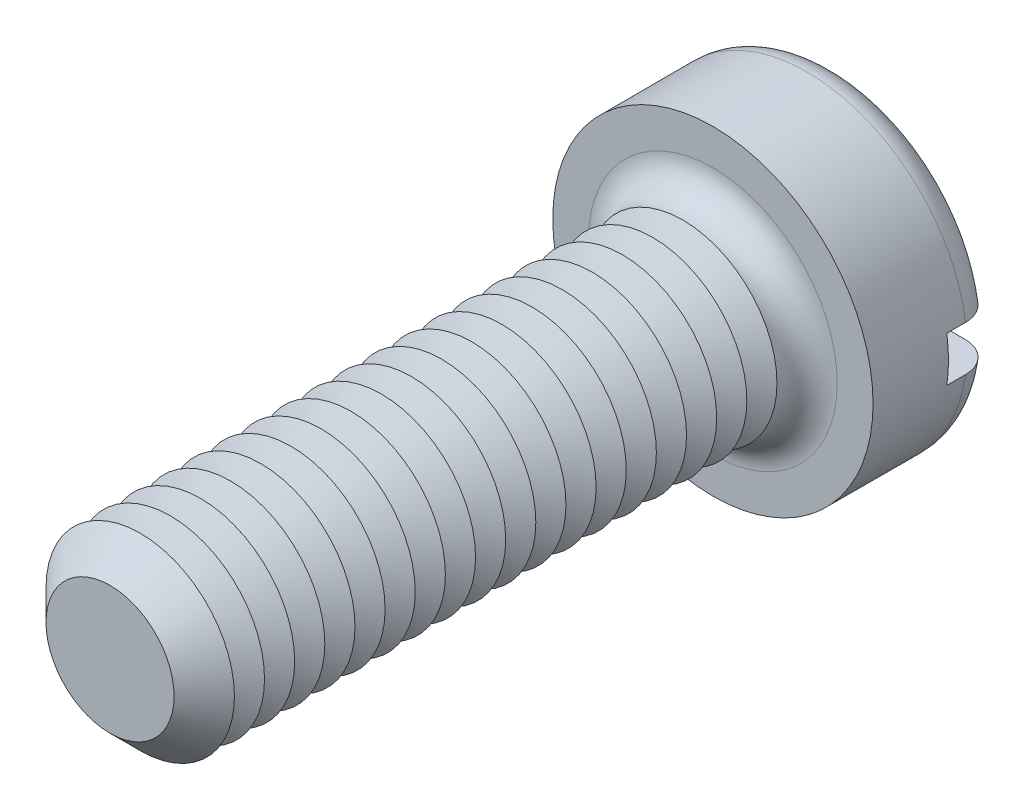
ISO-10303-21;
HEADER;
FILE_DESCRIPTION(('STEP AP214'),'2;1');
FILE_NAME('part.step','',(''),(''),'','','');
FILE_SCHEMA(('AUTOMOTIVE_DESIGN { 1 0 10303 214 1 1 1 1 }'));
ENDSEC;
DATA;
#1=APPLICATION_CONTEXT('core data for automotive mechanical design processes');
#2=APPLICATION_PROTOCOL_DEFINITION('international standard','automotive_design',2000,#1);
#3=PRODUCT_CONTEXT('',#1,'mechanical');
#4=PRODUCT('Part','Part','',(#3));
#5=PRODUCT_RELATED_PRODUCT_CATEGORY('part','',(#4));
#6=PRODUCT_DEFINITION_FORMATION('','',#4);
#7=PRODUCT_DEFINITION_CONTEXT('part definition',#1,'design');
#8=PRODUCT_DEFINITION('design','',#6,#7);
#9=PRODUCT_DEFINITION_SHAPE('','',#8);
#10=(LENGTH_UNIT() NAMED_UNIT(*) SI_UNIT(.MILLI.,.METRE.));
#11=(NAMED_UNIT(*) PLANE_ANGLE_UNIT() SI_UNIT($,.RADIAN.));
#12=(NAMED_UNIT(*) SI_UNIT($,.STERADIAN.) SOLID_ANGLE_UNIT());
#13=UNCERTAINTY_MEASURE_WITH_UNIT(LENGTH_MEASURE(1.E-05),#10,'distance_accuracy_value','');
#14=(GEOMETRIC_REPRESENTATION_CONTEXT(3) GLOBAL_UNCERTAINTY_ASSIGNED_CONTEXT((#13)) GLOBAL_UNIT_ASSIGNED_CONTEXT((#10,
#11,#12)) REPRESENTATION_CONTEXT('',''));
#15=CARTESIAN_POINT('',(0.,0.,0.));
#16=DIRECTION('',(0.,0.,1.));
#17=DIRECTION('',(1.,0.,0.));
#18=AXIS2_PLACEMENT_3D('',#15,#16,#17);
#19=CARTESIAN_POINT('',(0.,0.,-3.3));
#20=DIRECTION('',(0.,0.,1.));
#21=DIRECTION('',(1.,0.,0.));
#22=AXIS2_PLACEMENT_3D('',#19,#20,#21);
#23=PLANE('',#22);
#24=CARTESIAN_POINT('',(0.,0.,-3.3));
#25=DIRECTION('',(0.,0.,1.));
#26=DIRECTION('',(1.,0.,0.));
#27=AXIS2_PLACEMENT_3D('',#24,#25,#26);
#28=CIRCLE('',#27,3.45);
#29=CARTESIAN_POINT('',(-3.39742549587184,0.6,-3.3));
#30=VERTEX_POINT('',#29);
#31=CARTESIAN_POINT('',(3.39742549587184,0.6,-3.3));
#32=VERTEX_POINT('',#31);
#33=EDGE_CURVE('E116',#30,#32,#28,.F.);
#34=ORIENTED_EDGE('',*,*,#33,.T.);
#35=DIRECTION('',(1.,0.,0.));
#36=VECTOR('',#35,1.);
#37=CARTESIAN_POINT('',(-4.25,0.600000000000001,-3.3));
#38=LINE('',#37,#36);
#39=EDGE_CURVE('E111',#30,#32,#38,.T.);
#40=ORIENTED_EDGE('',*,*,#39,.F.);
#41=EDGE_LOOP('',(#34,#40));
#42=FACE_BOUND('',#41,.T.);
#43=ADVANCED_FACE('F39',(#42),#23,.F.);
#44=CARTESIAN_POINT('',(0.,0.,-2.5));
#45=DIRECTION('',(0.,0.,1.));
#46=DIRECTION('',(1.,0.,0.));
#47=AXIS2_PLACEMENT_3D('',#44,#45,#46);
#48=TOROIDAL_SURFACE('',#47,3.45,0.8);
#49=CARTESIAN_POINT('',(-4.06369072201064,0.600000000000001,-2.95537828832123));
#50=CARTESIAN_POINT('',(-4.03774340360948,0.600000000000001,-2.99245078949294));
#51=CARTESIAN_POINT('',(-4.00861849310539,0.600000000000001,-3.02734231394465));
#52=CARTESIAN_POINT('',(-3.94488199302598,0.600000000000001,-3.0917502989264));
#53=CARTESIAN_POINT('',(-3.91026320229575,0.600000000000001,-3.12125959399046));
#54=CARTESIAN_POINT('',(-3.83660561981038,0.600000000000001,-3.17403695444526));
#55=CARTESIAN_POINT('',(-3.79757117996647,0.6,-3.19731109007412));
#56=CARTESIAN_POINT('',(-3.71618817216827,0.6,-3.23703443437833));
#57=CARTESIAN_POINT('',(-3.67384041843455,0.6,-3.25348531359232));
#58=CARTESIAN_POINT('',(-3.58661930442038,0.6,-3.2792758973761));
#59=CARTESIAN_POINT('',(-3.54172669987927,0.6,-3.288550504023));
#60=CARTESIAN_POINT('',(-3.45102322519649,0.6,-3.29952632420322));
#61=CARTESIAN_POINT('',(-3.40521225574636,0.6,-3.30122671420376));
#62=CARTESIAN_POINT('',(-3.31340831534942,0.6,-3.29701196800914));
#63=CARTESIAN_POINT('',(-3.26741940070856,0.6,-3.29100823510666));
#64=CARTESIAN_POINT('',(-3.17708556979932,0.6,-3.27141469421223));
#65=CARTESIAN_POINT('',(-3.13274074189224,0.6,-3.25782447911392));
#66=CARTESIAN_POINT('',(-3.0466814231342,0.6,-3.22332549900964));
#67=CARTESIAN_POINT('',(-3.00498444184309,0.6,-3.20237301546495));
#68=CARTESIAN_POINT('',(-2.92572251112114,0.6,-3.15372961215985));
#69=CARTESIAN_POINT('',(-2.88815755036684,0.6,-3.12603871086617));
#70=CARTESIAN_POINT('',(-2.81847654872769,0.6,-3.06483322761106));
#71=CARTESIAN_POINT('',(-2.78633186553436,0.6,-3.03135128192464));
#72=CARTESIAN_POINT('',(-2.72824805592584,0.6,-2.95937651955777));
#73=CARTESIAN_POINT('',(-2.70230829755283,0.6,-2.92088421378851));
#74=CARTESIAN_POINT('',(-2.65791262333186,0.6,-2.84074227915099));
#75=CARTESIAN_POINT('',(-2.63932560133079,0.6,-2.79916531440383));
#76=CARTESIAN_POINT('',(-2.60958432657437,0.6,-2.7134333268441));
#77=CARTESIAN_POINT('',(-2.59842889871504,0.6,-2.66927871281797));
#78=CARTESIAN_POINT('',(-2.58411140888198,0.6,-2.58073966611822));
#79=CARTESIAN_POINT('',(-2.58077086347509,0.6,-2.5363840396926));
#80=CARTESIAN_POINT('',(-2.58167367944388,0.6,-2.44775208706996));
#81=CARTESIAN_POINT('',(-2.58591644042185,0.6,-2.40347575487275));
#82=CARTESIAN_POINT('',(-2.60175154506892,0.6,-2.31675105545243));
#83=CARTESIAN_POINT('',(-2.61326489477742,0.6,-2.27428821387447));
#84=CARTESIAN_POINT('',(-2.6431863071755,0.6,-2.19186794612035));
#85=CARTESIAN_POINT('',(-2.66159465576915,0.6,-2.15191062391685));
#86=CARTESIAN_POINT('',(-2.70494650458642,0.6,-2.07517696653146));
#87=CARTESIAN_POINT('',(-2.72995486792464,0.6,-2.03843731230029));
#88=CARTESIAN_POINT('',(-2.7856570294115,0.6,-1.96955746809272));
#89=CARTESIAN_POINT('',(-2.81635145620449,0.6,-1.93741778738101));
#90=CARTESIAN_POINT('',(-2.88329572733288,0.6,-1.87788048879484));
#91=CARTESIAN_POINT('',(-2.91965530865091,0.6,-1.85060625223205));
#92=CARTESIAN_POINT('',(-2.9963658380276,0.6,-1.80241044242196));
#93=CARTESIAN_POINT('',(-3.03671721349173,0.6,-1.78148955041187));
#94=CARTESIAN_POINT('',(-3.12111125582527,0.6,-1.74619829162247));
#95=CARTESIAN_POINT('',(-3.16521020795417,0.6,-1.73196239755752));
#96=CARTESIAN_POINT('',(-3.25516487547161,0.6,-1.71103773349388));
#97=CARTESIAN_POINT('',(-3.30102068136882,0.6,-1.70434935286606));
#98=CARTESIAN_POINT('',(-3.39352689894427,0.6,-1.69870104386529));
#99=CARTESIAN_POINT('',(-3.44018061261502,0.6,-1.69979487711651));
#100=CARTESIAN_POINT('',(-3.53263583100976,0.6,-1.70983959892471));
#101=CARTESIAN_POINT('',(-3.57843734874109,0.6,-1.71879036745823));
#102=CARTESIAN_POINT('',(-3.66763544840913,0.6,-1.74426972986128));
#103=CARTESIAN_POINT('',(-3.71104292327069,0.6,-1.76076015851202));
#104=CARTESIAN_POINT('',(-3.79442616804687,0.6,-1.80087686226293));
#105=CARTESIAN_POINT('',(-3.83440212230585,0.600000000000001,-1.82450275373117));
#106=CARTESIAN_POINT('',(-3.90929765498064,0.600000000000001,-1.87793548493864));
#107=CARTESIAN_POINT('',(-3.94426963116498,0.600000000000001,-1.90766887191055));
#108=CARTESIAN_POINT('',(-4.00864839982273,0.600000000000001,-1.9726503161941));
#109=CARTESIAN_POINT('',(-4.03805555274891,0.600000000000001,-2.00789801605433));
#110=CARTESIAN_POINT('',(-4.09009460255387,0.600000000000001,-2.08244463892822));
#111=CARTESIAN_POINT('',(-4.11280448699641,0.600000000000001,-2.12168912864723));
#112=CARTESIAN_POINT('',(-4.15124086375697,0.600000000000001,-2.2034588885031));
#113=CARTESIAN_POINT('',(-4.16696802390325,0.600000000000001,-2.24598384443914));
#114=CARTESIAN_POINT('',(-4.19085131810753,0.600000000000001,-2.33267862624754));
#115=CARTESIAN_POINT('',(-4.19907708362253,0.600000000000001,-2.37682928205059));
#116=CARTESIAN_POINT('',(-4.2079638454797,0.600000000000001,-2.46589754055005));
#117=CARTESIAN_POINT('',(-4.20862315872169,0.600000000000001,-2.51081531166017));
#118=CARTESIAN_POINT('',(-4.20236829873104,0.600000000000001,-2.59993343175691));
#119=CARTESIAN_POINT('',(-4.19548454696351,0.600000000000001,-2.64413593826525));
#120=CARTESIAN_POINT('',(-4.17439924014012,0.600000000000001,-2.73071930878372));
#121=CARTESIAN_POINT('',(-4.16020675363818,0.600000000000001,-2.77310235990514));
#122=CARTESIAN_POINT('',(-4.1318825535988,0.600000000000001,-2.83880495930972));
#123=CARTESIAN_POINT('',(-4.11991183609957,0.600000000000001,-2.86307959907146));
#124=CARTESIAN_POINT('',(-4.09356927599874,0.600000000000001,-2.91028856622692));
#125=CARTESIAN_POINT('',(-4.07919744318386,0.600000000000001,-2.9332228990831));
#126=CARTESIAN_POINT('',(-4.06369072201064,0.600000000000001,-2.95537828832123));
#127=B_SPLINE_CURVE_WITH_KNOTS('',3,(#49,#50,#51,#52,#53,#54,#55,#56,#57,#58,#59,#60,#61,#62,
#63,#64,#65,#66,#67,#68,#69,#70,#71,#72,#73,#74,#75,#76,#77,#78,#79,#80,#81,#82,#83,#84,#85,#86,
#87,#88,#89,#90,#91,#92,#93,#94,#95,#96,#97,#98,#99,#100,#101,#102,#103,#104,#105,#106,#107,
#108,#109,#110,#111,#112,#113,#114,#115,#116,#117,#118,#119,#120,#121,#122,#123,#124,#125,#126),
.UNSPECIFIED.,.T.,.F.,(4,2,2,2,2,2,2,2,2,2,2,2,2,2,2,2,2,2,2,2,2,2,2,2,2,2,2,2,2,2,2,2,2,2,2,2,
2,2,4),(0.,0.13565225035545,0.271483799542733,0.407182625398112,0.542848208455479,
0.679730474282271,0.816627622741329,0.955113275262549,1.09360635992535,1.23293614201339,
1.37226554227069,1.51083389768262,1.64938813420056,1.78534653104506,1.92128342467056,
2.0540840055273,2.18687407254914,2.31824564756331,2.44962267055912,2.58234229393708,
2.71507659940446,2.85080630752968,2.98655056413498,3.12491938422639,3.26329534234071,
3.40262816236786,3.54195885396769,3.68059194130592,3.81921757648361,3.95626453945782,
4.09330262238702,4.2286754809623,4.36403538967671,4.49812564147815,4.63224572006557,
4.76582687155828,4.89924267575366,4.98031194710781,5.0613808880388),.UNSPECIFIED.);
#128=CARTESIAN_POINT('',(-4.20743389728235,0.600000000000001,-2.50000000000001));
#129=VERTEX_POINT('',#128);
#130=EDGE_CURVE('E323',#129,#30,#127,.T.);
#131=ORIENTED_EDGE('',*,*,#130,.F.);
#132=CARTESIAN_POINT('',(0.,0.,-2.5));
#133=DIRECTION('',(0.,0.,1.));
#134=DIRECTION('',(1.,0.,0.));
#135=AXIS2_PLACEMENT_3D('',#132,#133,#134);
#136=CIRCLE('',#135,4.25);
#137=CARTESIAN_POINT('',(4.20743389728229,0.599999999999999,-2.5));
#138=VERTEX_POINT('',#137);
#139=EDGE_CURVE('E125',#138,#129,#136,.T.);
#140=ORIENTED_EDGE('',*,*,#139,.F.);
#141=CARTESIAN_POINT('',(2.63947327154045,0.6,-2.79608831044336));
#142=CARTESIAN_POINT('',(2.65655980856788,0.6,-2.83790320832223));
#143=CARTESIAN_POINT('',(2.67725642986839,0.6,-2.87828303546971));
#144=CARTESIAN_POINT('',(2.72519250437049,0.6,-2.95500233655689));
#145=CARTESIAN_POINT('',(2.75244152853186,0.6,-2.9913357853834));
#146=CARTESIAN_POINT('',(2.81257938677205,0.6,-3.05889430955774));
#147=CARTESIAN_POINT('',(2.84545995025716,0.6,-3.09012674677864));
#148=CARTESIAN_POINT('',(2.91591143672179,0.6,-3.14672620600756));
#149=CARTESIAN_POINT('',(2.95348119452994,0.6,-3.17209468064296));
#150=CARTESIAN_POINT('',(3.03291143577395,0.6,-3.21669611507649));
#151=CARTESIAN_POINT('',(3.07483186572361,0.6,-3.23582234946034));
#152=CARTESIAN_POINT('',(3.16126659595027,0.6,-3.26686062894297));
#153=CARTESIAN_POINT('',(3.2057811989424,0.6,-3.27877183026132));
#154=CARTESIAN_POINT('',(3.29669878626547,0.6,-3.29514603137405));
#155=CARTESIAN_POINT('',(3.34311773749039,0.6,-3.29952056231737));
#156=CARTESIAN_POINT('',(3.43603189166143,0.6,-3.30040472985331));
#157=CARTESIAN_POINT('',(3.48252709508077,0.6,-3.29691431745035));
#158=CARTESIAN_POINT('',(3.57420049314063,0.6,-3.28214240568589));
#159=CARTESIAN_POINT('',(3.61938038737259,0.6,-3.27087147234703));
#160=CARTESIAN_POINT('',(3.70717477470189,0.6,-3.24082890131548));
#161=CARTESIAN_POINT('',(3.74978938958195,0.6,-3.22205762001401));
#162=CARTESIAN_POINT('',(3.83078828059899,0.6,-3.17773607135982));
#163=CARTESIAN_POINT('',(3.86921015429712,0.599999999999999,-3.15225453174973));
#164=CARTESIAN_POINT('',(3.94116038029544,0.599999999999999,-3.09512672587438));
#165=CARTESIAN_POINT('',(3.9746890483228,0.599999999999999,-3.06348085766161));
#166=CARTESIAN_POINT('',(4.03545911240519,0.599999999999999,-2.99534640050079));
#167=CARTESIAN_POINT('',(4.06277344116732,0.599999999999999,-2.95892285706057));
#168=CARTESIAN_POINT('',(4.11082191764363,0.599999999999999,-2.88196698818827));
#169=CARTESIAN_POINT('',(4.13155647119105,0.599999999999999,-2.84143491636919));
#170=CARTESIAN_POINT('',(4.16563480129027,0.599999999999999,-2.75787550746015));
#171=CARTESIAN_POINT('',(4.1790544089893,0.599999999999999,-2.71487908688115));
#172=CARTESIAN_POINT('',(4.19843340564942,0.599999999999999,-2.62723691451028));
#173=CARTESIAN_POINT('',(4.20439310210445,0.599999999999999,-2.58259123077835));
#174=CARTESIAN_POINT('',(4.2086595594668,0.599999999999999,-2.49321831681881));
#175=CARTESIAN_POINT('',(4.20701422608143,0.599999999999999,-2.4484933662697));
#176=CARTESIAN_POINT('',(4.1962295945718,0.599999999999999,-2.35995704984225));
#177=CARTESIAN_POINT('',(4.18709040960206,0.599999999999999,-2.31614567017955));
#178=CARTESIAN_POINT('',(4.16160290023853,0.599999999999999,-2.23072100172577));
#179=CARTESIAN_POINT('',(4.14526169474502,0.599999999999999,-2.18910558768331));
#180=CARTESIAN_POINT('',(4.10585410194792,0.599999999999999,-2.10919238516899));
#181=CARTESIAN_POINT('',(4.08278762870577,0.599999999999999,-2.07089463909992));
#182=CARTESIAN_POINT('',(4.030487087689,0.599999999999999,-1.99851484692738));
#183=CARTESIAN_POINT('',(4.00122628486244,0.599999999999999,-1.9644521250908));
#184=CARTESIAN_POINT('',(3.93744772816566,0.599999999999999,-1.90166877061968));
#185=CARTESIAN_POINT('',(3.90292977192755,0.599999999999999,-1.87294834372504));
#186=CARTESIAN_POINT('',(3.82928727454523,0.599999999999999,-1.82137853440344));
#187=CARTESIAN_POINT('',(3.79012374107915,0.6,-1.79858484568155));
#188=CARTESIAN_POINT('',(3.70856025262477,0.6,-1.75980712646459));
#189=CARTESIAN_POINT('',(3.66616010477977,0.6,-1.74382350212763));
#190=CARTESIAN_POINT('',(3.57878495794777,0.6,-1.71891499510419));
#191=CARTESIAN_POINT('',(3.53378519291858,0.6,-1.71007699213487));
#192=CARTESIAN_POINT('',(3.44294322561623,0.6,-1.69998722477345));
#193=CARTESIAN_POINT('',(3.3971009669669,0.6,-1.69873596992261));
#194=CARTESIAN_POINT('',(3.30531297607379,0.6,-1.70385439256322));
#195=CARTESIAN_POINT('',(3.25937213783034,0.6,-1.71031204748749));
#196=CARTESIAN_POINT('',(3.1692099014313,0.6,-1.73080107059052));
#197=CARTESIAN_POINT('',(3.12498860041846,0.6,-1.74483286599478));
#198=CARTESIAN_POINT('',(3.03926209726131,0.6,-1.78018941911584));
#199=CARTESIAN_POINT('',(2.99777407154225,0.6,-1.80155586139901));
#200=CARTESIAN_POINT('',(2.91899881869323,0.6,-1.85098881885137));
#201=CARTESIAN_POINT('',(2.88171158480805,0.6,-1.8790553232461));
#202=CARTESIAN_POINT('',(2.81266124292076,0.6,-1.94094884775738));
#203=CARTESIAN_POINT('',(2.78086710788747,0.6,-1.97474122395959));
#204=CARTESIAN_POINT('',(2.72353615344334,0.6,-2.0472724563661));
#205=CARTESIAN_POINT('',(2.69799841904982,0.6,-2.08601058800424));
#206=CARTESIAN_POINT('',(2.65444718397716,0.6,-2.16655019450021));
#207=CARTESIAN_POINT('',(2.63629889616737,0.6,-2.20827875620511));
#208=CARTESIAN_POINT('',(2.60744942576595,0.6,-2.29424821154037));
#209=CARTESIAN_POINT('',(2.59674901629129,0.6,-2.33848936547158));
#210=CARTESIAN_POINT('',(2.5833312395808,0.6,-2.42714258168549));
#211=CARTESIAN_POINT('',(2.58043995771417,0.6,-2.47152848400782));
#212=CARTESIAN_POINT('',(2.58224493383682,0.6,-2.56010574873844));
#213=CARTESIAN_POINT('',(2.58693104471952,0.6,-2.60429729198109));
#214=CARTESIAN_POINT('',(2.60020046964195,0.6,-2.67311978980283));
#215=CARTESIAN_POINT('',(2.60635343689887,0.6,-2.69824441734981));
#216=CARTESIAN_POINT('',(2.62110140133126,0.6,-2.74776540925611));
#217=CARTESIAN_POINT('',(2.62969634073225,0.6,-2.77216179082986));
#218=CARTESIAN_POINT('',(2.63947327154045,0.6,-2.79608831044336));
#219=B_SPLINE_CURVE_WITH_KNOTS('',3,(#141,#142,#143,#144,#145,#146,#147,#148,#149,#150,#151,
#152,#153,#154,#155,#156,#157,#158,#159,#160,#161,#162,#163,#164,#165,#166,#167,#168,#169,#170,
#171,#172,#173,#174,#175,#176,#177,#178,#179,#180,#181,#182,#183,#184,#185,#186,#187,#188,#189,
#190,#191,#192,#193,#194,#195,#196,#197,#198,#199,#200,#201,#202,#203,#204,#205,#206,#207,#208,
#209,#210,#211,#212,#213,#214,#215,#216,#217,#218),.UNSPECIFIED.,.T.,.F.,(4,2,2,2,2,2,2,2,2,2,2,
2,2,2,2,2,2,2,2,2,2,2,2,2,2,2,2,2,2,2,2,2,2,2,2,2,2,2,4),(0.,0.135416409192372,
0.271031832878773,0.406449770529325,0.541834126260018,0.679424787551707,0.817031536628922,
0.956242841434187,1.09545501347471,1.23447850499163,1.37349539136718,1.51114036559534,
1.64877645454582,1.78470267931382,1.92062051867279,2.05510117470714,2.1895762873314,
2.32320547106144,2.45683263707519,2.59032801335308,2.72382509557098,2.85791055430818,
2.99200117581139,3.12730969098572,3.26262627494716,3.39956435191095,3.53651162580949,
3.67503685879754,3.81356990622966,3.95290367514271,4.09223721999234,4.23075602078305,
4.36925455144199,4.50509949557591,4.6409585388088,4.77376594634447,4.90639565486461,
4.98388287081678,5.06136825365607),.UNSPECIFIED.);
#220=EDGE_CURVE('E325',#32,#138,#219,.T.);
#221=ORIENTED_EDGE('',*,*,#220,.F.);
#222=ORIENTED_EDGE('',*,*,#33,.F.);
#223=EDGE_LOOP('',(#131,#140,#221,#222));
#224=FACE_BOUND('',#223,.T.);
#225=ADVANCED_FACE('F307',(#224),#48,.T.);
#226=CARTESIAN_POINT('',(0.,0.,-3.3));
#227=DIRECTION('',(0.,0.,1.));
#228=DIRECTION('',(1.,0.,0.));
#229=AXIS2_PLACEMENT_3D('',#226,#227,#228);
#230=CYLINDRICAL_SURFACE('',#229,4.25);
#231=DIRECTION('',(0.,0.,1.));
#232=VECTOR('',#231,1.);
#233=CARTESIAN_POINT('',(4.20743389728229,0.599999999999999,-3.3));
#234=LINE('',#233,#232);
#235=CARTESIAN_POINT('',(4.20743389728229,0.599999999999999,-2.));
#236=VERTEX_POINT('',#235);
#237=EDGE_CURVE('E340',#138,#236,#234,.T.);
#238=ORIENTED_EDGE('',*,*,#237,.F.);
#239=ORIENTED_EDGE('',*,*,#139,.T.);
#240=DIRECTION('',(0.,0.,1.));
#241=VECTOR('',#240,1.);
#242=CARTESIAN_POINT('',(-4.20743389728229,0.600000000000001,-3.3));
#243=LINE('',#242,#241);
#244=CARTESIAN_POINT('',(-4.20743389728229,0.600000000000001,-2.));
#245=VERTEX_POINT('',#244);
#246=EDGE_CURVE('E63',#245,#129,#243,.F.);
#247=ORIENTED_EDGE('',*,*,#246,.F.);
#248=CARTESIAN_POINT('',(0.,0.,-2.));
#249=DIRECTION('',(0.,0.,-1.));
#250=DIRECTION('',(-1.,0.,0.));
#251=AXIS2_PLACEMENT_3D('',#248,#249,#250);
#252=CIRCLE('',#251,4.25);
#253=CARTESIAN_POINT('',(-4.20743389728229,-0.599999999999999,-2.));
#254=VERTEX_POINT('',#253);
#255=EDGE_CURVE('E43',#245,#254,#252,.F.);
#256=ORIENTED_EDGE('',*,*,#255,.T.);
#257=DIRECTION('',(0.,0.,1.));
#258=VECTOR('',#257,1.);
#259=CARTESIAN_POINT('',(-4.20743389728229,-0.599999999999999,-3.3));
#260=LINE('',#259,#258);
#261=CARTESIAN_POINT('',(-4.20743389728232,-0.599999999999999,-2.5));
#262=VERTEX_POINT('',#261);
#263=EDGE_CURVE('E337',#262,#254,#260,.T.);
#264=ORIENTED_EDGE('',*,*,#263,.F.);
#265=CARTESIAN_POINT('',(4.20743389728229,-0.600000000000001,-2.5));
#266=VERTEX_POINT('',#265);
#267=EDGE_CURVE('E127',#262,#266,#136,.T.);
#268=ORIENTED_EDGE('',*,*,#267,.T.);
#269=DIRECTION('',(0.,0.,1.));
#270=VECTOR('',#269,1.);
#271=CARTESIAN_POINT('',(4.20743389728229,-0.600000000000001,-3.3));
#272=LINE('',#271,#270);
#273=CARTESIAN_POINT('',(4.20743389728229,-0.600000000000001,-2.));
#274=VERTEX_POINT('',#273);
#275=EDGE_CURVE('E55',#274,#266,#272,.F.);
#276=ORIENTED_EDGE('',*,*,#275,.F.);
#277=EDGE_CURVE('E11',#274,#236,#252,.F.);
#278=ORIENTED_EDGE('',*,*,#277,.T.);
#279=EDGE_LOOP('',(#238,#239,#247,#256,#264,#268,#276,#278));
#280=FACE_BOUND('',#279,.T.);
#281=CARTESIAN_POINT('',(0.,0.,0.));
#282=DIRECTION('',(0.,0.,1.));
#283=DIRECTION('',(1.,0.,0.));
#284=AXIS2_PLACEMENT_3D('',#281,#282,#283);
#285=CIRCLE('',#284,4.25);
#286=CARTESIAN_POINT('',(4.25,0.,0.));
#287=VERTEX_POINT('',#286);
#288=EDGE_CURVE('E343',#287,#287,#285,.T.);
#289=ORIENTED_EDGE('',*,*,#288,.F.);
#290=EDGE_LOOP('',(#289));
#291=FACE_BOUND('',#290,.T.);
#292=ADVANCED_FACE('F303',(#280,#291),#230,.T.);
#293=CARTESIAN_POINT('',(3.39742549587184,-0.6,-3.3));
#294=VERTEX_POINT('',#293);
#295=CARTESIAN_POINT('',(-3.39742549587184,-0.6,-3.3));
#296=VERTEX_POINT('',#295);
#297=EDGE_CURVE('E109',#294,#296,#28,.F.);
#298=ORIENTED_EDGE('',*,*,#297,.T.);
#299=DIRECTION('',(-1.,0.,0.));
#300=VECTOR('',#299,1.);
#301=CARTESIAN_POINT('',(-4.25,-0.599999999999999,-3.3));
#302=LINE('',#301,#300);
#303=EDGE_CURVE('E96',#294,#296,#302,.T.);
#304=ORIENTED_EDGE('',*,*,#303,.F.);
#305=EDGE_LOOP('',(#298,#304));
#306=FACE_BOUND('',#305,.T.);
#307=ADVANCED_FACE('F108',(#306),#23,.F.);
#308=CARTESIAN_POINT('',(0.,0.,0.));
#309=DIRECTION('',(0.,0.,1.));
#310=DIRECTION('',(1.,0.,0.));
#311=AXIS2_PLACEMENT_3D('',#308,#309,#310);
#312=PLANE('',#311);
#313=CARTESIAN_POINT('',(0.,0.,0.));
#314=DIRECTION('',(0.,0.,1.));
#315=DIRECTION('',(1.,0.,0.));
#316=AXIS2_PLACEMENT_3D('',#313,#314,#315);
#317=CIRCLE('',#316,3.3);
#318=CARTESIAN_POINT('',(3.3,0.,0.));
#319=VERTEX_POINT('',#318);
#320=EDGE_CURVE('E115',#319,#319,#317,.F.);
#321=ORIENTED_EDGE('',*,*,#320,.T.);
#322=EDGE_LOOP('',(#321));
#323=FACE_BOUND('',#322,.T.);
#324=ORIENTED_EDGE('',*,*,#288,.T.);
#325=EDGE_LOOP('',(#324));
#326=FACE_BOUND('',#325,.T.);
#327=ADVANCED_FACE('F302',(#323,#326),#312,.T.);
#328=CARTESIAN_POINT('',(-4.06369072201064,-0.599999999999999,-2.95537828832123));
#329=CARTESIAN_POINT('',(-4.08928577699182,-0.599999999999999,-2.91880204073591));
#330=CARTESIAN_POINT('',(-4.11182555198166,-0.599999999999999,-2.88005030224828));
#331=CARTESIAN_POINT('',(-4.15010404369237,-0.599999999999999,-2.79928452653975));
#332=CARTESIAN_POINT('',(-4.16583526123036,-0.599999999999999,-2.75726695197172));
#333=CARTESIAN_POINT('',(-4.19000286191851,-0.599999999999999,-2.67118996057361));
#334=CARTESIAN_POINT('',(-4.19844101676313,-0.599999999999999,-2.62713104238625));
#335=CARTESIAN_POINT('',(-4.20777174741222,-0.599999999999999,-2.53823222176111));
#336=CARTESIAN_POINT('',(-4.20866608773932,-0.599999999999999,-2.49339250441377));
#337=CARTESIAN_POINT('',(-4.20289683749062,-0.599999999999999,-2.40433856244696));
#338=CARTESIAN_POINT('',(-4.19625607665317,-0.599999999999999,-2.36012285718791));
#339=CARTESIAN_POINT('',(-4.17565084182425,-0.599999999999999,-2.27343166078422));
#340=CARTESIAN_POINT('',(-4.16168615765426,-0.599999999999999,-2.23095621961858));
#341=CARTESIAN_POINT('',(-4.12683188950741,-0.599999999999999,-2.14890863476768));
#342=CARTESIAN_POINT('',(-4.10593663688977,-0.599999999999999,-2.10933890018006));
#343=CARTESIAN_POINT('',(-4.05783763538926,-0.599999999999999,-2.03424145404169));
#344=CARTESIAN_POINT('',(-4.03063375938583,-0.599999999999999,-1.99871382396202));
#345=CARTESIAN_POINT('',(-3.97052236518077,-0.599999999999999,-1.93246905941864));
#346=CARTESIAN_POINT('',(-3.93758114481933,-0.599999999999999,-1.90178251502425));
#347=CARTESIAN_POINT('',(-3.86706007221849,-0.599999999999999,-1.84630837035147));
#348=CARTESIAN_POINT('',(-3.82948001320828,-0.6,-1.82152103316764));
#349=CARTESIAN_POINT('',(-3.75033766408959,-0.6,-1.77826995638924));
#350=CARTESIAN_POINT('',(-3.70873831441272,-0.6,-1.7598740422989));
#351=CARTESIAN_POINT('',(-3.62306661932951,-0.6,-1.73023196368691));
#352=CARTESIAN_POINT('',(-3.57899411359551,-0.6,-1.71898626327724));
#353=CARTESIAN_POINT('',(-3.48904845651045,-0.6,-1.70382025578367));
#354=CARTESIAN_POINT('',(-3.44315982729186,-0.6,-1.69999172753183));
#355=CARTESIAN_POINT('',(-3.35138360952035,-0.6,-1.7000083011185));
#356=CARTESIAN_POINT('',(-3.30549602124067,-0.6,-1.70385391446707));
#357=CARTESIAN_POINT('',(-3.21452492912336,-0.6,-1.71917227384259));
#358=CARTESIAN_POINT('',(-3.16945455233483,-0.6,-1.73072307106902));
#359=CARTESIAN_POINT('',(-3.08188104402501,-0.6,-1.76120640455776));
#360=CARTESIAN_POINT('',(-3.0393780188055,-0.6,-1.78013924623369));
#361=CARTESIAN_POINT('',(-2.95805296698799,-0.6,-1.82493384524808));
#362=CARTESIAN_POINT('',(-2.9192403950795,-0.6,-1.85081278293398));
#363=CARTESIAN_POINT('',(-2.84656695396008,-0.6,-1.90878317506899));
#364=CARTESIAN_POINT('',(-2.81270591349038,-0.6,-1.94087441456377));
#365=CARTESIAN_POINT('',(-2.75131050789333,-0.6,-2.01002500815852));
#366=CARTESIAN_POINT('',(-2.72371339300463,-0.6,-2.04702860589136));
#367=CARTESIAN_POINT('',(-2.67528742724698,-0.6,-2.12522869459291));
#368=CARTESIAN_POINT('',(-2.65445765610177,-0.6,-2.1664246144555));
#369=CARTESIAN_POINT('',(-2.62065354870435,-0.6,-2.25087266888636));
#370=CARTESIAN_POINT('',(-2.60751663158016,-0.6,-2.29405971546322));
#371=CARTESIAN_POINT('',(-2.58885106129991,-0.6,-2.38204659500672));
#372=CARTESIAN_POINT('',(-2.58332131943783,-0.6,-2.42684619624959));
#373=CARTESIAN_POINT('',(-2.58009777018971,-0.6,-2.51580379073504));
#374=CARTESIAN_POINT('',(-2.58224575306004,-0.6,-2.55995612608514));
#375=CARTESIAN_POINT('',(-2.59395205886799,-0.6,-2.64726495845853));
#376=CARTESIAN_POINT('',(-2.60351013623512,-0.6,-2.69042148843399));
#377=CARTESIAN_POINT('',(-2.62967159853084,-0.6,-2.77438771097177));
#378=CARTESIAN_POINT('',(-2.64625243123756,-0.6,-2.81520444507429));
#379=CARTESIAN_POINT('',(-2.68592348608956,-0.6,-2.89353901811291));
#380=CARTESIAN_POINT('',(-2.70901418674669,-0.6,-2.9310566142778));
#381=CARTESIAN_POINT('',(-2.7614318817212,-0.6,-3.00240040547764));
#382=CARTESIAN_POINT('',(-2.79085487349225,-0.6,-3.03615603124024));
#383=CARTESIAN_POINT('',(-2.85483456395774,-0.6,-3.09838834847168));
#384=CARTESIAN_POINT('',(-2.88939187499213,-0.6,-3.12686440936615));
#385=CARTESIAN_POINT('',(-2.96351967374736,-0.6,-3.17841283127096));
#386=CARTESIAN_POINT('',(-3.00318741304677,-0.6,-3.20134539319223));
#387=CARTESIAN_POINT('',(-3.08576649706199,-0.6,-3.24034364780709));
#388=CARTESIAN_POINT('',(-3.12867814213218,-0.6,-3.25640870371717));
#389=CARTESIAN_POINT('',(-3.21724048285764,-0.6,-3.28143816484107));
#390=CARTESIAN_POINT('',(-3.26292314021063,-0.6,-3.29028963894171));
#391=CARTESIAN_POINT('',(-3.35512527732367,-0.6,-3.30021681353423));
#392=CARTESIAN_POINT('',(-3.40164474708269,-0.6,-3.30129260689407));
#393=CARTESIAN_POINT('',(-3.49429978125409,-0.6,-3.29560589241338));
#394=CARTESIAN_POINT('',(-3.54043436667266,-0.6,-3.28882735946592));
#395=CARTESIAN_POINT('',(-3.63090382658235,-0.6,-3.26755492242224));
#396=CARTESIAN_POINT('',(-3.67523831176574,-0.6,-3.25305935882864));
#397=CARTESIAN_POINT('',(-3.76046509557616,-0.6,-3.21686867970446));
#398=CARTESIAN_POINT('',(-3.80138087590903,-0.599999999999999,-3.1952288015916));
#399=CARTESIAN_POINT('',(-3.8788986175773,-0.599999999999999,-3.14531817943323));
#400=CARTESIAN_POINT('',(-3.91550599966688,-0.599999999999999,-3.11705590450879));
#401=CARTESIAN_POINT('',(-3.97074313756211,-0.599999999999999,-3.06628809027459));
#402=CARTESIAN_POINT('',(-3.99100743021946,-0.599999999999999,-3.04553102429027));
#403=CARTESIAN_POINT('',(-4.02917385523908,-0.599999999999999,-3.00194762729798));
#404=CARTESIAN_POINT('',(-4.04707600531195,-0.599999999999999,-2.97912131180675));
#405=CARTESIAN_POINT('',(-4.06369072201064,-0.599999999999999,-2.95537828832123));
#406=B_SPLINE_CURVE_WITH_KNOTS('',3,(#328,#329,#330,#331,#332,#333,#334,#335,#336,#337,#338,
#339,#340,#341,#342,#343,#344,#345,#346,#347,#348,#349,#350,#351,#352,#353,#354,#355,#356,#357,
#358,#359,#360,#361,#362,#363,#364,#365,#366,#367,#368,#369,#370,#371,#372,#373,#374,#375,#376,
#377,#378,#379,#380,#381,#382,#383,#384,#385,#386,#387,#388,#389,#390,#391,#392,#393,#394,#395,
#396,#397,#398,#399,#400,#401,#402,#403,#404,#405),.UNSPECIFIED.,.T.,.F.,(4,2,2,2,2,2,2,2,2,2,2,
2,2,2,2,2,2,2,2,2,2,2,2,2,2,2,2,2,2,2,2,2,2,2,2,2,2,2,4),(0.,0.133821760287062,
0.267790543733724,0.401726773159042,0.535631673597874,0.669131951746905,0.802636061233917,
0.936249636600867,1.06986590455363,1.2042952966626,1.3387306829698,1.47455198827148,
1.61038210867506,1.74788249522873,1.88539204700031,2.02431612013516,2.16324594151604,
2.30252260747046,2.4417944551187,2.57960263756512,2.71739207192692,2.85215325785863,
2.98689515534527,3.11887666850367,3.25085380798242,3.38241030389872,3.51397647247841,
3.64769871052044,3.78143690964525,3.91826005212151,4.05509587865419,4.19403485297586,
4.33297216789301,4.47219345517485,4.61144469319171,4.74964356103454,4.887666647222,
4.97453605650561,5.06140481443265),.UNSPECIFIED.);
#407=EDGE_CURVE('E103',#296,#262,#406,.T.);
#408=ORIENTED_EDGE('',*,*,#407,.F.);
#409=ORIENTED_EDGE('',*,*,#297,.F.);
#410=CARTESIAN_POINT('',(2.63947327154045,-0.6,-2.79608831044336));
#411=CARTESIAN_POINT('',(2.62285766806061,-0.6,-2.75541510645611));
#412=CARTESIAN_POINT('',(2.60963282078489,-0.6,-2.71332585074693));
#413=CARTESIAN_POINT('',(2.59042394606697,-0.6,-2.62749460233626));
#414=CARTESIAN_POINT('',(2.58444686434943,-0.6,-2.58375106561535));
#415=CARTESIAN_POINT('',(2.57995287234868,-0.6,-2.49588524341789));
#416=CARTESIAN_POINT('',(2.58143477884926,-0.6,-2.45176301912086));
#417=CARTESIAN_POINT('',(2.59180622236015,-0.6,-2.36440906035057));
#418=CARTESIAN_POINT('',(2.60069434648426,-0.6,-2.32117715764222));
#419=CARTESIAN_POINT('',(2.62554964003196,-0.6,-2.23689909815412));
#420=CARTESIAN_POINT('',(2.6415022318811,-0.6,-2.19584863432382));
#421=CARTESIAN_POINT('',(2.67996913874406,-0.6,-2.11694797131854));
#422=CARTESIAN_POINT('',(2.70248409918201,-0.6,-2.07909808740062));
#423=CARTESIAN_POINT('',(2.75378972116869,-0.6,-2.00702296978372));
#424=CARTESIAN_POINT('',(2.7826732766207,-0.6,-1.97286389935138));
#425=CARTESIAN_POINT('',(2.84564717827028,-0.6,-1.90974167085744));
#426=CARTESIAN_POINT('',(2.87973812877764,-0.6,-1.88077911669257));
#427=CARTESIAN_POINT('',(2.95300941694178,-0.6,-1.82817307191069));
#428=CARTESIAN_POINT('',(2.99228920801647,-0.6,-1.8046680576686));
#429=CARTESIAN_POINT('',(3.07419050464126,-0.6,-1.76446470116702));
#430=CARTESIAN_POINT('',(3.11681231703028,-0.6,-1.74776698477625));
#431=CARTESIAN_POINT('',(3.20492149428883,-0.6,-1.72140945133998));
#432=CARTESIAN_POINT('',(3.25044365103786,-0.6,-1.71186578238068));
#433=CARTESIAN_POINT('',(3.34244451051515,-0.6,-1.70053183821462));
#434=CARTESIAN_POINT('',(3.38892324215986,-0.6,-1.69874179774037));
#435=CARTESIAN_POINT('',(3.48165030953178,-0.6,-1.70299737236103));
#436=CARTESIAN_POINT('',(3.52789766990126,-0.6,-1.70906439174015));
#437=CARTESIAN_POINT('',(3.61869999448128,-0.6,-1.72893768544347));
#438=CARTESIAN_POINT('',(3.6632550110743,-0.6,-1.742743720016));
#439=CARTESIAN_POINT('',(3.7490339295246,-0.6,-1.77760539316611));
#440=CARTESIAN_POINT('',(3.79028083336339,-0.600000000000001,-1.79860440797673));
#441=CARTESIAN_POINT('',(3.86860401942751,-0.600000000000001,-1.84731105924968));
#442=CARTESIAN_POINT('',(3.90568056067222,-0.600000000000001,-1.87501827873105));
#443=CARTESIAN_POINT('',(3.97412845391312,-0.600000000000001,-1.93599408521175));
#444=CARTESIAN_POINT('',(4.00556369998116,-0.600000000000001,-1.96919094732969));
#445=CARTESIAN_POINT('',(4.06233546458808,-0.600000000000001,-2.0404445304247));
#446=CARTESIAN_POINT('',(4.08767237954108,-0.600000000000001,-2.07850093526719));
#447=CARTESIAN_POINT('',(4.13122502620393,-0.600000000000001,-2.15791791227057));
#448=CARTESIAN_POINT('',(4.14951966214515,-0.600000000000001,-2.19923522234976));
#449=CARTESIAN_POINT('',(4.17884974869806,-0.600000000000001,-2.28437065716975));
#450=CARTESIAN_POINT('',(4.18988555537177,-0.600000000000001,-2.32818865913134));
#451=CARTESIAN_POINT('',(4.20430724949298,-0.600000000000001,-2.41670951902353));
#452=CARTESIAN_POINT('',(4.2077528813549,-0.600000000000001,-2.46140265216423));
#453=CARTESIAN_POINT('',(4.20706844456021,-0.600000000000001,-2.55073028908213));
#454=CARTESIAN_POINT('',(4.20293856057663,-0.600000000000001,-2.595364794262));
#455=CARTESIAN_POINT('',(4.18724926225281,-0.600000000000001,-2.68317733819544));
#456=CARTESIAN_POINT('',(4.17571081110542,-0.600000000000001,-2.72635912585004));
#457=CARTESIAN_POINT('',(4.14556645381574,-0.600000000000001,-2.81017999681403));
#458=CARTESIAN_POINT('',(4.12696052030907,-0.600000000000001,-2.85081907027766));
#459=CARTESIAN_POINT('',(4.08317014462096,-0.600000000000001,-2.92852328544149));
#460=CARTESIAN_POINT('',(4.0579684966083,-0.600000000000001,-2.96557872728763));
#461=CARTESIAN_POINT('',(4.00174565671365,-0.600000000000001,-3.034972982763));
#462=CARTESIAN_POINT('',(3.97072429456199,-0.600000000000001,-3.06731165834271));
#463=CARTESIAN_POINT('',(3.90349659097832,-0.600000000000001,-3.12662735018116));
#464=CARTESIAN_POINT('',(3.86725240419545,-0.600000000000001,-3.15356146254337));
#465=CARTESIAN_POINT('',(3.79079809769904,-0.600000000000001,-3.20104156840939));
#466=CARTESIAN_POINT('',(3.75058775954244,-0.6,-3.22158720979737));
#467=CARTESIAN_POINT('',(3.6668595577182,-0.6,-3.25595832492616));
#468=CARTESIAN_POINT('',(3.62330947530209,-0.6,-3.26970530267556));
#469=CARTESIAN_POINT('',(3.53453348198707,-0.6,-3.28979004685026));
#470=CARTESIAN_POINT('',(3.48930745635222,-0.6,-3.29612730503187));
#471=CARTESIAN_POINT('',(3.39787506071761,-0.6,-3.30128612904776));
#472=CARTESIAN_POINT('',(3.35166346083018,-0.6,-3.30001513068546));
#473=CARTESIAN_POINT('',(3.26009663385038,-0.6,-3.28980210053));
#474=CARTESIAN_POINT('',(3.21474142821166,-0.6,-3.28085987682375));
#475=CARTESIAN_POINT('',(3.12577990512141,-0.6,-3.2554540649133));
#476=CARTESIAN_POINT('',(3.08219120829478,-0.6,-3.23892872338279));
#477=CARTESIAN_POINT('',(2.99839730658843,-0.6,-3.1987810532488));
#478=CARTESIAN_POINT('',(2.95819301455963,-0.6,-3.17515681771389));
#479=CARTESIAN_POINT('',(2.88239372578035,-0.6,-3.12147666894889));
#480=CARTESIAN_POINT('',(2.84679445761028,-0.6,-3.09142678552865));
#481=CARTESIAN_POINT('',(2.78127483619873,-0.6,-3.02571584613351));
#482=CARTESIAN_POINT('',(2.75134725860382,-0.6,-2.99006203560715));
#483=CARTESIAN_POINT('',(2.70767232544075,-0.6,-2.92780516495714));
#484=CARTESIAN_POINT('',(2.69197340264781,-0.6,-2.90254809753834));
#485=CARTESIAN_POINT('',(2.66349078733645,-0.6,-2.8504392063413));
#486=CARTESIAN_POINT('',(2.65070705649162,-0.6,-2.82358740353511));
#487=CARTESIAN_POINT('',(2.63947327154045,-0.6,-2.79608831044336));
#488=B_SPLINE_CURVE_WITH_KNOTS('',3,(#410,#411,#412,#413,#414,#415,#416,#417,#418,#419,#420,
#421,#422,#423,#424,#425,#426,#427,#428,#429,#430,#431,#432,#433,#434,#435,#436,#437,#438,#439,
#440,#441,#442,#443,#444,#445,#446,#447,#448,#449,#450,#451,#452,#453,#454,#455,#456,#457,#458,
#459,#460,#461,#462,#463,#464,#465,#466,#467,#468,#469,#470,#471,#472,#473,#474,#475,#476,#477,
#478,#479,#480,#481,#482,#483,#484,#485,#486,#487),.UNSPECIFIED.,.T.,.F.,(4,2,2,2,2,2,2,2,2,2,2,
2,2,2,2,2,2,2,2,2,2,2,2,2,2,2,2,2,2,2,2,2,2,2,2,2,2,2,4),(0.,0.131701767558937,
0.263529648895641,0.395336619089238,0.527118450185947,0.658629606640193,0.790153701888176,
0.923740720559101,1.05734325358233,1.19403504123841,1.33073939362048,1.46961778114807,
1.60850037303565,1.74776210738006,1.88701952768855,2.02520497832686,2.16338184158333,
2.29987843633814,2.43636615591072,2.57127672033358,2.7061806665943,2.84001889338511,
2.97385385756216,3.1073117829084,3.24077022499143,3.37458034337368,3.50839437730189,
3.64323196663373,3.77807698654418,3.91444452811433,4.05082142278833,4.18886086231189,
4.32690375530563,4.46609131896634,4.60531630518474,4.74441121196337,4.88332773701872,
4.97237227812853,5.06141564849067),.UNSPECIFIED.);
#489=EDGE_CURVE('E92',#266,#294,#488,.T.);
#490=ORIENTED_EDGE('',*,*,#489,.F.);
#491=ORIENTED_EDGE('',*,*,#267,.F.);
#492=EDGE_LOOP('',(#408,#409,#490,#491));
#493=FACE_BOUND('',#492,.T.);
#494=ADVANCED_FACE('F113',(#493),#48,.T.);
#495=CARTESIAN_POINT('',(0.,0.,0.8));
#496=DIRECTION('',(0.,0.,1.));
#497=DIRECTION('',(1.,0.,0.));
#498=AXIS2_PLACEMENT_3D('',#495,#496,#497);
#499=TOROIDAL_SURFACE('',#498,3.3,0.8);
#500=ORIENTED_EDGE('',*,*,#320,.F.);
#501=EDGE_LOOP('',(#500));
#502=FACE_BOUND('',#501,.T.);
#503=CARTESIAN_POINT('',(0.,0.,0.8));
#504=DIRECTION('',(0.,0.,-1.));
#505=DIRECTION('',(-1.,0.,0.));
#506=AXIS2_PLACEMENT_3D('',#503,#504,#505);
#507=CIRCLE('',#506,2.5);
#508=CARTESIAN_POINT('',(-2.5,0.,0.8));
#509=VERTEX_POINT('',#508);
#510=EDGE_CURVE('E348',#509,#509,#507,.T.);
#511=ORIENTED_EDGE('',*,*,#510,.T.);
#512=EDGE_LOOP('',(#511));
#513=FACE_BOUND('',#512,.T.);
#514=ADVANCED_FACE('F295',(#502,#513),#499,.F.);
#515=CARTESIAN_POINT('',(0.,0.,1.2));
#516=DIRECTION('',(0.,0.,-1.));
#517=DIRECTION('',(-1.,0.,0.));
#518=AXIS2_PLACEMENT_3D('',#515,#516,#517);
#519=CONICAL_SURFACE('',#518,1.80717967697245,1.0471975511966);
#520=ORIENTED_EDGE('',*,*,#510,.F.);
#521=EDGE_LOOP('',(#520));
#522=FACE_BOUND('',#521,.T.);
#523=CARTESIAN_POINT('',(0.,0.,1.2));
#524=DIRECTION('',(0.,0.,-1.));
#525=DIRECTION('',(-1.,0.,0.));
#526=AXIS2_PLACEMENT_3D('',#523,#524,#525);
#527=CIRCLE('',#526,1.80717967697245);
#528=CARTESIAN_POINT('',(-1.80717967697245,0.,1.2));
#529=VERTEX_POINT('',#528);
#530=EDGE_CURVE('E354',#529,#529,#527,.T.);
#531=ORIENTED_EDGE('',*,*,#530,.T.);
#532=EDGE_LOOP('',(#531));
#533=FACE_BOUND('',#532,.T.);
#534=ADVANCED_FACE('F291',(#522,#533),#519,.T.);
#535=CARTESIAN_POINT('',(0.,0.,1.6));
#536=DIRECTION('',(0.,0.,1.));
#537=DIRECTION('',(1.,0.,0.));
#538=AXIS2_PLACEMENT_3D('',#535,#536,#537);
#539=CONICAL_SURFACE('',#538,2.5,1.0471975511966);
#540=ORIENTED_EDGE('',*,*,#530,.F.);
#541=EDGE_LOOP('',(#540));
#542=FACE_BOUND('',#541,.T.);
#543=CARTESIAN_POINT('',(0.,0.,1.6));
#544=DIRECTION('',(0.,0.,-1.));
#545=DIRECTION('',(-1.,0.,0.));
#546=AXIS2_PLACEMENT_3D('',#543,#544,#545);
#547=CIRCLE('',#546,2.5);
#548=CARTESIAN_POINT('',(-2.5,0.,1.6));
#549=VERTEX_POINT('',#548);
#550=EDGE_CURVE('E359',#549,#549,#547,.T.);
#551=ORIENTED_EDGE('',*,*,#550,.T.);
#552=EDGE_LOOP('',(#551));
#553=FACE_BOUND('',#552,.T.);
#554=ADVANCED_FACE('F287',(#542,#553),#539,.T.);
#555=CARTESIAN_POINT('',(0.,0.,2.));
#556=DIRECTION('',(0.,0.,-1.));
#557=DIRECTION('',(-1.,0.,0.));
#558=AXIS2_PLACEMENT_3D('',#555,#556,#557);
#559=CONICAL_SURFACE('',#558,1.80717967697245,1.0471975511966);
#560=ORIENTED_EDGE('',*,*,#550,.F.);
#561=EDGE_LOOP('',(#560));
#562=FACE_BOUND('',#561,.T.);
#563=CARTESIAN_POINT('',(0.,0.,2.));
#564=DIRECTION('',(0.,0.,-1.));
#565=DIRECTION('',(-1.,0.,0.));
#566=AXIS2_PLACEMENT_3D('',#563,#564,#565);
#567=CIRCLE('',#566,1.80717967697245);
#568=CARTESIAN_POINT('',(-1.80717967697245,0.,2.));
#569=VERTEX_POINT('',#568);
#570=EDGE_CURVE('E363',#569,#569,#567,.T.);
#571=ORIENTED_EDGE('',*,*,#570,.T.);
#572=EDGE_LOOP('',(#571));
#573=FACE_BOUND('',#572,.T.);
#574=ADVANCED_FACE('F283',(#562,#573),#559,.T.);
#575=CARTESIAN_POINT('',(0.,0.,2.4));
#576=DIRECTION('',(0.,0.,1.));
#577=DIRECTION('',(1.,0.,0.));
#578=AXIS2_PLACEMENT_3D('',#575,#576,#577);
#579=CONICAL_SURFACE('',#578,2.5,1.0471975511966);
#580=ORIENTED_EDGE('',*,*,#570,.F.);
#581=EDGE_LOOP('',(#580));
#582=FACE_BOUND('',#581,.T.);
#583=CARTESIAN_POINT('',(0.,0.,2.4));
#584=DIRECTION('',(0.,0.,-1.));
#585=DIRECTION('',(-1.,0.,0.));
#586=AXIS2_PLACEMENT_3D('',#583,#584,#585);
#587=CIRCLE('',#586,2.5);
#588=CARTESIAN_POINT('',(-2.5,0.,2.4));
#589=VERTEX_POINT('',#588);
#590=EDGE_CURVE('E367',#589,#589,#587,.T.);
#591=ORIENTED_EDGE('',*,*,#590,.T.);
#592=EDGE_LOOP('',(#591));
#593=FACE_BOUND('',#592,.T.);
#594=ADVANCED_FACE('F279',(#582,#593),#579,.T.);
#595=CARTESIAN_POINT('',(0.,0.,2.8));
#596=DIRECTION('',(0.,0.,-1.));
#597=DIRECTION('',(-1.,0.,0.));
#598=AXIS2_PLACEMENT_3D('',#595,#596,#597);
#599=CONICAL_SURFACE('',#598,1.80717967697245,1.0471975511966);
#600=ORIENTED_EDGE('',*,*,#590,.F.);
#601=EDGE_LOOP('',(#600));
#602=FACE_BOUND('',#601,.T.);
#603=CARTESIAN_POINT('',(0.,0.,2.8));
#604=DIRECTION('',(0.,0.,-1.));
#605=DIRECTION('',(-1.,0.,0.));
#606=AXIS2_PLACEMENT_3D('',#603,#604,#605);
#607=CIRCLE('',#606,1.80717967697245);
#608=CARTESIAN_POINT('',(-1.80717967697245,0.,2.8));
#609=VERTEX_POINT('',#608);
#610=EDGE_CURVE('E371',#609,#609,#607,.T.);
#611=ORIENTED_EDGE('',*,*,#610,.T.);
#612=EDGE_LOOP('',(#611));
#613=FACE_BOUND('',#612,.T.);
#614=ADVANCED_FACE('F275',(#602,#613),#599,.T.);
#615=CARTESIAN_POINT('',(0.,0.,3.2));
#616=DIRECTION('',(0.,0.,1.));
#617=DIRECTION('',(1.,0.,0.));
#618=AXIS2_PLACEMENT_3D('',#615,#616,#617);
#619=CONICAL_SURFACE('',#618,2.5,1.0471975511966);
#620=ORIENTED_EDGE('',*,*,#610,.F.);
#621=EDGE_LOOP('',(#620));
#622=FACE_BOUND('',#621,.T.);
#623=CARTESIAN_POINT('',(0.,0.,3.2));
#624=DIRECTION('',(0.,0.,-1.));
#625=DIRECTION('',(-1.,0.,0.));
#626=AXIS2_PLACEMENT_3D('',#623,#624,#625);
#627=CIRCLE('',#626,2.5);
#628=CARTESIAN_POINT('',(-2.5,0.,3.2));
#629=VERTEX_POINT('',#628);
#630=EDGE_CURVE('E375',#629,#629,#627,.T.);
#631=ORIENTED_EDGE('',*,*,#630,.T.);
#632=EDGE_LOOP('',(#631));
#633=FACE_BOUND('',#632,.T.);
#634=ADVANCED_FACE('F271',(#622,#633),#619,.T.);
#635=CARTESIAN_POINT('',(0.,0.,3.6));
#636=DIRECTION('',(0.,0.,-1.));
#637=DIRECTION('',(-1.,0.,0.));
#638=AXIS2_PLACEMENT_3D('',#635,#636,#637);
#639=CONICAL_SURFACE('',#638,1.80717967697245,1.0471975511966);
#640=ORIENTED_EDGE('',*,*,#630,.F.);
#641=EDGE_LOOP('',(#640));
#642=FACE_BOUND('',#641,.T.);
#643=CARTESIAN_POINT('',(0.,0.,3.6));
#644=DIRECTION('',(0.,0.,-1.));
#645=DIRECTION('',(-1.,0.,0.));
#646=AXIS2_PLACEMENT_3D('',#643,#644,#645);
#647=CIRCLE('',#646,1.80717967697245);
#648=CARTESIAN_POINT('',(-1.80717967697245,0.,3.6));
#649=VERTEX_POINT('',#648);
#650=EDGE_CURVE('E379',#649,#649,#647,.T.);
#651=ORIENTED_EDGE('',*,*,#650,.T.);
#652=EDGE_LOOP('',(#651));
#653=FACE_BOUND('',#652,.T.);
#654=ADVANCED_FACE('F267',(#642,#653),#639,.T.);
#655=CARTESIAN_POINT('',(0.,0.,4.));
#656=DIRECTION('',(0.,0.,1.));
#657=DIRECTION('',(1.,0.,0.));
#658=AXIS2_PLACEMENT_3D('',#655,#656,#657);
#659=CONICAL_SURFACE('',#658,2.5,1.0471975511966);
#660=ORIENTED_EDGE('',*,*,#650,.F.);
#661=EDGE_LOOP('',(#660));
#662=FACE_BOUND('',#661,.T.);
#663=CARTESIAN_POINT('',(0.,0.,4.));
#664=DIRECTION('',(0.,0.,-1.));
#665=DIRECTION('',(-1.,0.,0.));
#666=AXIS2_PLACEMENT_3D('',#663,#664,#665);
#667=CIRCLE('',#666,2.5);
#668=CARTESIAN_POINT('',(-2.5,0.,4.));
#669=VERTEX_POINT('',#668);
#670=EDGE_CURVE('E382',#669,#669,#667,.T.);
#671=ORIENTED_EDGE('',*,*,#670,.T.);
#672=EDGE_LOOP('',(#671));
#673=FACE_BOUND('',#672,.T.);
#674=ADVANCED_FACE('F263',(#662,#673),#659,.T.);
#675=CARTESIAN_POINT('',(0.,0.,4.4));
#676=DIRECTION('',(0.,0.,-1.));
#677=DIRECTION('',(-1.,0.,0.));
#678=AXIS2_PLACEMENT_3D('',#675,#676,#677);
#679=CONICAL_SURFACE('',#678,1.80717967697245,1.0471975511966);
#680=ORIENTED_EDGE('',*,*,#670,.F.);
#681=EDGE_LOOP('',(#680));
#682=FACE_BOUND('',#681,.T.);
#683=CARTESIAN_POINT('',(0.,0.,4.4));
#684=DIRECTION('',(0.,0.,-1.));
#685=DIRECTION('',(-1.,0.,0.));
#686=AXIS2_PLACEMENT_3D('',#683,#684,#685);
#687=CIRCLE('',#686,1.80717967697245);
#688=CARTESIAN_POINT('',(-1.80717967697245,0.,4.4));
#689=VERTEX_POINT('',#688);
#690=EDGE_CURVE('E385',#689,#689,#687,.T.);
#691=ORIENTED_EDGE('',*,*,#690,.T.);
#692=EDGE_LOOP('',(#691));
#693=FACE_BOUND('',#692,.T.);
#694=ADVANCED_FACE('F259',(#682,#693),#679,.T.);
#695=CARTESIAN_POINT('',(0.,0.,4.8));
#696=DIRECTION('',(0.,0.,1.));
#697=DIRECTION('',(1.,0.,0.));
#698=AXIS2_PLACEMENT_3D('',#695,#696,#697);
#699=CONICAL_SURFACE('',#698,2.5,1.0471975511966);
#700=ORIENTED_EDGE('',*,*,#690,.F.);
#701=EDGE_LOOP('',(#700));
#702=FACE_BOUND('',#701,.T.);
#703=CARTESIAN_POINT('',(0.,0.,4.8));
#704=DIRECTION('',(0.,0.,-1.));
#705=DIRECTION('',(-1.,0.,0.));
#706=AXIS2_PLACEMENT_3D('',#703,#704,#705);
#707=CIRCLE('',#706,2.5);
#708=CARTESIAN_POINT('',(-2.5,0.,4.8));
#709=VERTEX_POINT('',#708);
#710=EDGE_CURVE('E389',#709,#709,#707,.T.);
#711=ORIENTED_EDGE('',*,*,#710,.T.);
#712=EDGE_LOOP('',(#711));
#713=FACE_BOUND('',#712,.T.);
#714=ADVANCED_FACE('F255',(#702,#713),#699,.T.);
#715=CARTESIAN_POINT('',(0.,0.,5.2));
#716=DIRECTION('',(0.,0.,-1.));
#717=DIRECTION('',(-1.,0.,0.));
#718=AXIS2_PLACEMENT_3D('',#715,#716,#717);
#719=CONICAL_SURFACE('',#718,1.80717967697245,1.0471975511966);
#720=ORIENTED_EDGE('',*,*,#710,.F.);
#721=EDGE_LOOP('',(#720));
#722=FACE_BOUND('',#721,.T.);
#723=CARTESIAN_POINT('',(0.,0.,5.2));
#724=DIRECTION('',(0.,0.,-1.));
#725=DIRECTION('',(-1.,0.,0.));
#726=AXIS2_PLACEMENT_3D('',#723,#724,#725);
#727=CIRCLE('',#726,1.80717967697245);
#728=CARTESIAN_POINT('',(-1.80717967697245,0.,5.2));
#729=VERTEX_POINT('',#728);
#730=EDGE_CURVE('E393',#729,#729,#727,.T.);
#731=ORIENTED_EDGE('',*,*,#730,.T.);
#732=EDGE_LOOP('',(#731));
#733=FACE_BOUND('',#732,.T.);
#734=ADVANCED_FACE('F251',(#722,#733),#719,.T.);
#735=CARTESIAN_POINT('',(0.,0.,5.6));
#736=DIRECTION('',(0.,0.,1.));
#737=DIRECTION('',(1.,0.,0.));
#738=AXIS2_PLACEMENT_3D('',#735,#736,#737);
#739=CONICAL_SURFACE('',#738,2.5,1.0471975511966);
#740=ORIENTED_EDGE('',*,*,#730,.F.);
#741=EDGE_LOOP('',(#740));
#742=FACE_BOUND('',#741,.T.);
#743=CARTESIAN_POINT('',(0.,0.,5.6));
#744=DIRECTION('',(0.,0.,-1.));
#745=DIRECTION('',(-1.,0.,0.));
#746=AXIS2_PLACEMENT_3D('',#743,#744,#745);
#747=CIRCLE('',#746,2.5);
#748=CARTESIAN_POINT('',(-2.5,0.,5.6));
#749=VERTEX_POINT('',#748);
#750=EDGE_CURVE('E397',#749,#749,#747,.T.);
#751=ORIENTED_EDGE('',*,*,#750,.T.);
#752=EDGE_LOOP('',(#751));
#753=FACE_BOUND('',#752,.T.);
#754=ADVANCED_FACE('F247',(#742,#753),#739,.T.);
#755=CARTESIAN_POINT('',(0.,0.,6.));
#756=DIRECTION('',(0.,0.,-1.));
#757=DIRECTION('',(-1.,0.,0.));
#758=AXIS2_PLACEMENT_3D('',#755,#756,#757);
#759=CONICAL_SURFACE('',#758,1.80717967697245,1.0471975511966);
#760=ORIENTED_EDGE('',*,*,#750,.F.);
#761=EDGE_LOOP('',(#760));
#762=FACE_BOUND('',#761,.T.);
#763=CARTESIAN_POINT('',(0.,0.,6.));
#764=DIRECTION('',(0.,0.,-1.));
#765=DIRECTION('',(-1.,0.,0.));
#766=AXIS2_PLACEMENT_3D('',#763,#764,#765);
#767=CIRCLE('',#766,1.80717967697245);
#768=CARTESIAN_POINT('',(-1.80717967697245,0.,6.));
#769=VERTEX_POINT('',#768);
#770=EDGE_CURVE('E401',#769,#769,#767,.T.);
#771=ORIENTED_EDGE('',*,*,#770,.T.);
#772=EDGE_LOOP('',(#771));
#773=FACE_BOUND('',#772,.T.);
#774=ADVANCED_FACE('F243',(#762,#773),#759,.T.);
#775=CARTESIAN_POINT('',(0.,0.,6.4));
#776=DIRECTION('',(0.,0.,1.));
#777=DIRECTION('',(1.,0.,0.));
#778=AXIS2_PLACEMENT_3D('',#775,#776,#777);
#779=CONICAL_SURFACE('',#778,2.5,1.0471975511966);
#780=ORIENTED_EDGE('',*,*,#770,.F.);
#781=EDGE_LOOP('',(#780));
#782=FACE_BOUND('',#781,.T.);
#783=CARTESIAN_POINT('',(0.,0.,6.4));
#784=DIRECTION('',(0.,0.,-1.));
#785=DIRECTION('',(-1.,0.,0.));
#786=AXIS2_PLACEMENT_3D('',#783,#784,#785);
#787=CIRCLE('',#786,2.5);
#788=CARTESIAN_POINT('',(-2.5,0.,6.4));
#789=VERTEX_POINT('',#788);
#790=EDGE_CURVE('E405',#789,#789,#787,.T.);
#791=ORIENTED_EDGE('',*,*,#790,.T.);
#792=EDGE_LOOP('',(#791));
#793=FACE_BOUND('',#792,.T.);
#794=ADVANCED_FACE('F239',(#782,#793),#779,.T.);
#795=CARTESIAN_POINT('',(0.,0.,6.8));
#796=DIRECTION('',(0.,0.,-1.));
#797=DIRECTION('',(-1.,0.,0.));
#798=AXIS2_PLACEMENT_3D('',#795,#796,#797);
#799=CONICAL_SURFACE('',#798,1.80717967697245,1.0471975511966);
#800=ORIENTED_EDGE('',*,*,#790,.F.);
#801=EDGE_LOOP('',(#800));
#802=FACE_BOUND('',#801,.T.);
#803=CARTESIAN_POINT('',(0.,0.,6.8));
#804=DIRECTION('',(0.,0.,-1.));
#805=DIRECTION('',(-1.,0.,0.));
#806=AXIS2_PLACEMENT_3D('',#803,#804,#805);
#807=CIRCLE('',#806,1.80717967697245);
#808=CARTESIAN_POINT('',(-1.80717967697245,0.,6.8));
#809=VERTEX_POINT('',#808);
#810=EDGE_CURVE('E409',#809,#809,#807,.T.);
#811=ORIENTED_EDGE('',*,*,#810,.T.);
#812=EDGE_LOOP('',(#811));
#813=FACE_BOUND('',#812,.T.);
#814=ADVANCED_FACE('F235',(#802,#813),#799,.T.);
#815=CARTESIAN_POINT('',(0.,0.,7.2));
#816=DIRECTION('',(0.,0.,1.));
#817=DIRECTION('',(1.,0.,0.));
#818=AXIS2_PLACEMENT_3D('',#815,#816,#817);
#819=CONICAL_SURFACE('',#818,2.5,1.0471975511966);
#820=ORIENTED_EDGE('',*,*,#810,.F.);
#821=EDGE_LOOP('',(#820));
#822=FACE_BOUND('',#821,.T.);
#823=CARTESIAN_POINT('',(0.,0.,7.2));
#824=DIRECTION('',(0.,0.,-1.));
#825=DIRECTION('',(-1.,0.,0.));
#826=AXIS2_PLACEMENT_3D('',#823,#824,#825);
#827=CIRCLE('',#826,2.5);
#828=CARTESIAN_POINT('',(-2.5,0.,7.2));
#829=VERTEX_POINT('',#828);
#830=EDGE_CURVE('E413',#829,#829,#827,.T.);
#831=ORIENTED_EDGE('',*,*,#830,.T.);
#832=EDGE_LOOP('',(#831));
#833=FACE_BOUND('',#832,.T.);
#834=ADVANCED_FACE('F231',(#822,#833),#819,.T.);
#835=CARTESIAN_POINT('',(0.,0.,7.6));
#836=DIRECTION('',(0.,0.,-1.));
#837=DIRECTION('',(-1.,0.,0.));
#838=AXIS2_PLACEMENT_3D('',#835,#836,#837);
#839=CONICAL_SURFACE('',#838,1.80717967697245,1.0471975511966);
#840=ORIENTED_EDGE('',*,*,#830,.F.);
#841=EDGE_LOOP('',(#840));
#842=FACE_BOUND('',#841,.T.);
#843=CARTESIAN_POINT('',(0.,0.,7.6));
#844=DIRECTION('',(0.,0.,-1.));
#845=DIRECTION('',(-1.,0.,0.));
#846=AXIS2_PLACEMENT_3D('',#843,#844,#845);
#847=CIRCLE('',#846,1.80717967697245);
#848=CARTESIAN_POINT('',(-1.80717967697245,0.,7.6));
#849=VERTEX_POINT('',#848);
#850=EDGE_CURVE('E417',#849,#849,#847,.T.);
#851=ORIENTED_EDGE('',*,*,#850,.T.);
#852=EDGE_LOOP('',(#851));
#853=FACE_BOUND('',#852,.T.);
#854=ADVANCED_FACE('F227',(#842,#853),#839,.T.);
#855=CARTESIAN_POINT('',(0.,0.,8.));
#856=DIRECTION('',(0.,0.,1.));
#857=DIRECTION('',(1.,0.,0.));
#858=AXIS2_PLACEMENT_3D('',#855,#856,#857);
#859=CONICAL_SURFACE('',#858,2.5,1.0471975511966);
#860=ORIENTED_EDGE('',*,*,#850,.F.);
#861=EDGE_LOOP('',(#860));
#862=FACE_BOUND('',#861,.T.);
#863=CARTESIAN_POINT('',(0.,0.,8.));
#864=DIRECTION('',(0.,0.,-1.));
#865=DIRECTION('',(-1.,0.,0.));
#866=AXIS2_PLACEMENT_3D('',#863,#864,#865);
#867=CIRCLE('',#866,2.5);
#868=CARTESIAN_POINT('',(-2.5,0.,8.));
#869=VERTEX_POINT('',#868);
#870=EDGE_CURVE('E420',#869,#869,#867,.T.);
#871=ORIENTED_EDGE('',*,*,#870,.T.);
#872=EDGE_LOOP('',(#871));
#873=FACE_BOUND('',#872,.T.);
#874=ADVANCED_FACE('F223',(#862,#873),#859,.T.);
#875=CARTESIAN_POINT('',(0.,0.,8.4));
#876=DIRECTION('',(0.,0.,-1.));
#877=DIRECTION('',(-1.,0.,0.));
#878=AXIS2_PLACEMENT_3D('',#875,#876,#877);
#879=CONICAL_SURFACE('',#878,1.80717967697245,1.0471975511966);
#880=ORIENTED_EDGE('',*,*,#870,.F.);
#881=EDGE_LOOP('',(#880));
#882=FACE_BOUND('',#881,.T.);
#883=CARTESIAN_POINT('',(0.,0.,8.4));
#884=DIRECTION('',(0.,0.,-1.));
#885=DIRECTION('',(-1.,0.,0.));
#886=AXIS2_PLACEMENT_3D('',#883,#884,#885);
#887=CIRCLE('',#886,1.80717967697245);
#888=CARTESIAN_POINT('',(-1.80717967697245,0.,8.4));
#889=VERTEX_POINT('',#888);
#890=EDGE_CURVE('E424',#889,#889,#887,.T.);
#891=ORIENTED_EDGE('',*,*,#890,.T.);
#892=EDGE_LOOP('',(#891));
#893=FACE_BOUND('',#892,.T.);
#894=ADVANCED_FACE('F219',(#882,#893),#879,.T.);
#895=CARTESIAN_POINT('',(0.,0.,8.8));
#896=DIRECTION('',(0.,0.,1.));
#897=DIRECTION('',(1.,0.,0.));
#898=AXIS2_PLACEMENT_3D('',#895,#896,#897);
#899=CONICAL_SURFACE('',#898,2.5,1.0471975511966);
#900=ORIENTED_EDGE('',*,*,#890,.F.);
#901=EDGE_LOOP('',(#900));
#902=FACE_BOUND('',#901,.T.);
#903=CARTESIAN_POINT('',(0.,0.,8.8));
#904=DIRECTION('',(0.,0.,-1.));
#905=DIRECTION('',(-1.,0.,0.));
#906=AXIS2_PLACEMENT_3D('',#903,#904,#905);
#907=CIRCLE('',#906,2.5);
#908=CARTESIAN_POINT('',(-2.5,0.,8.8));
#909=VERTEX_POINT('',#908);
#910=EDGE_CURVE('E428',#909,#909,#907,.T.);
#911=ORIENTED_EDGE('',*,*,#910,.T.);
#912=EDGE_LOOP('',(#911));
#913=FACE_BOUND('',#912,.T.);
#914=ADVANCED_FACE('F215',(#902,#913),#899,.T.);
#915=CARTESIAN_POINT('',(0.,0.,9.2));
#916=DIRECTION('',(0.,0.,-1.));
#917=DIRECTION('',(-1.,0.,0.));
#918=AXIS2_PLACEMENT_3D('',#915,#916,#917);
#919=CONICAL_SURFACE('',#918,1.80717967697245,1.0471975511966);
#920=ORIENTED_EDGE('',*,*,#910,.F.);
#921=EDGE_LOOP('',(#920));
#922=FACE_BOUND('',#921,.T.);
#923=CARTESIAN_POINT('',(0.,0.,9.2));
#924=DIRECTION('',(0.,0.,-1.));
#925=DIRECTION('',(-1.,0.,0.));
#926=AXIS2_PLACEMENT_3D('',#923,#924,#925);
#927=CIRCLE('',#926,1.80717967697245);
#928=CARTESIAN_POINT('',(-1.80717967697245,0.,9.2));
#929=VERTEX_POINT('',#928);
#930=EDGE_CURVE('E432',#929,#929,#927,.T.);
#931=ORIENTED_EDGE('',*,*,#930,.T.);
#932=EDGE_LOOP('',(#931));
#933=FACE_BOUND('',#932,.T.);
#934=ADVANCED_FACE('F211',(#922,#933),#919,.T.);
#935=CARTESIAN_POINT('',(0.,0.,9.6));
#936=DIRECTION('',(0.,0.,1.));
#937=DIRECTION('',(1.,0.,0.));
#938=AXIS2_PLACEMENT_3D('',#935,#936,#937);
#939=CONICAL_SURFACE('',#938,2.5,1.0471975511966);
#940=ORIENTED_EDGE('',*,*,#930,.F.);
#941=EDGE_LOOP('',(#940));
#942=FACE_BOUND('',#941,.T.);
#943=CARTESIAN_POINT('',(0.,0.,9.6));
#944=DIRECTION('',(0.,0.,-1.));
#945=DIRECTION('',(-1.,0.,0.));
#946=AXIS2_PLACEMENT_3D('',#943,#944,#945);
#947=CIRCLE('',#946,2.5);
#948=CARTESIAN_POINT('',(-2.5,0.,9.6));
#949=VERTEX_POINT('',#948);
#950=EDGE_CURVE('E436',#949,#949,#947,.T.);
#951=ORIENTED_EDGE('',*,*,#950,.T.);
#952=EDGE_LOOP('',(#951));
#953=FACE_BOUND('',#952,.T.);
#954=ADVANCED_FACE('F207',(#942,#953),#939,.T.);
#955=CARTESIAN_POINT('',(0.,0.,10.));
#956=DIRECTION('',(0.,0.,-1.));
#957=DIRECTION('',(-1.,0.,0.));
#958=AXIS2_PLACEMENT_3D('',#955,#956,#957);
#959=CONICAL_SURFACE('',#958,1.80717967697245,1.0471975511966);
#960=ORIENTED_EDGE('',*,*,#950,.F.);
#961=EDGE_LOOP('',(#960));
#962=FACE_BOUND('',#961,.T.);
#963=CARTESIAN_POINT('',(0.,0.,10.));
#964=DIRECTION('',(0.,0.,-1.));
#965=DIRECTION('',(-1.,0.,0.));
#966=AXIS2_PLACEMENT_3D('',#963,#964,#965);
#967=CIRCLE('',#966,1.80717967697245);
#968=CARTESIAN_POINT('',(-1.80717967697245,0.,10.));
#969=VERTEX_POINT('',#968);
#970=EDGE_CURVE('E440',#969,#969,#967,.T.);
#971=ORIENTED_EDGE('',*,*,#970,.T.);
#972=EDGE_LOOP('',(#971));
#973=FACE_BOUND('',#972,.T.);
#974=ADVANCED_FACE('F203',(#962,#973),#959,.T.);
#975=CARTESIAN_POINT('',(0.,0.,10.4));
#976=DIRECTION('',(0.,0.,1.));
#977=DIRECTION('',(1.,0.,0.));
#978=AXIS2_PLACEMENT_3D('',#975,#976,#977);
#979=CONICAL_SURFACE('',#978,2.5,1.0471975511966);
#980=ORIENTED_EDGE('',*,*,#970,.F.);
#981=EDGE_LOOP('',(#980));
#982=FACE_BOUND('',#981,.T.);
#983=CARTESIAN_POINT('',(0.,0.,10.4));
#984=DIRECTION('',(0.,0.,-1.));
#985=DIRECTION('',(-1.,0.,0.));
#986=AXIS2_PLACEMENT_3D('',#983,#984,#985);
#987=CIRCLE('',#986,2.5);
#988=CARTESIAN_POINT('',(-2.5,0.,10.4));
#989=VERTEX_POINT('',#988);
#990=EDGE_CURVE('E444',#989,#989,#987,.T.);
#991=ORIENTED_EDGE('',*,*,#990,.T.);
#992=EDGE_LOOP('',(#991));
#993=FACE_BOUND('',#992,.T.);
#994=ADVANCED_FACE('F199',(#982,#993),#979,.T.);
#995=CARTESIAN_POINT('',(0.,0.,10.8));
#996=DIRECTION('',(0.,0.,-1.));
#997=DIRECTION('',(-1.,0.,0.));
#998=AXIS2_PLACEMENT_3D('',#995,#996,#997);
#999=CONICAL_SURFACE('',#998,1.80717967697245,1.0471975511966);
#1000=ORIENTED_EDGE('',*,*,#990,.F.);
#1001=EDGE_LOOP('',(#1000));
#1002=FACE_BOUND('',#1001,.T.);
#1003=CARTESIAN_POINT('',(0.,0.,10.8));
#1004=DIRECTION('',(0.,0.,-1.));
#1005=DIRECTION('',(-1.,0.,0.));
#1006=AXIS2_PLACEMENT_3D('',#1003,#1004,#1005);
#1007=CIRCLE('',#1006,1.80717967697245);
#1008=CARTESIAN_POINT('',(-1.80717967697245,0.,10.8));
#1009=VERTEX_POINT('',#1008);
#1010=EDGE_CURVE('E448',#1009,#1009,#1007,.T.);
#1011=ORIENTED_EDGE('',*,*,#1010,.T.);
#1012=EDGE_LOOP('',(#1011));
#1013=FACE_BOUND('',#1012,.T.);
#1014=ADVANCED_FACE('F195',(#1002,#1013),#999,.T.);
#1015=CARTESIAN_POINT('',(0.,0.,11.2));
#1016=DIRECTION('',(0.,0.,1.));
#1017=DIRECTION('',(1.,0.,0.));
#1018=AXIS2_PLACEMENT_3D('',#1015,#1016,#1017);
#1019=CONICAL_SURFACE('',#1018,2.5,1.0471975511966);
#1020=ORIENTED_EDGE('',*,*,#1010,.F.);
#1021=EDGE_LOOP('',(#1020));
#1022=FACE_BOUND('',#1021,.T.);
#1023=CARTESIAN_POINT('',(0.,0.,11.2));
#1024=DIRECTION('',(0.,0.,-1.));
#1025=DIRECTION('',(-1.,0.,0.));
#1026=AXIS2_PLACEMENT_3D('',#1023,#1024,#1025);
#1027=CIRCLE('',#1026,2.5);
#1028=CARTESIAN_POINT('',(-2.5,0.,11.2));
#1029=VERTEX_POINT('',#1028);
#1030=EDGE_CURVE('E452',#1029,#1029,#1027,.T.);
#1031=ORIENTED_EDGE('',*,*,#1030,.T.);
#1032=EDGE_LOOP('',(#1031));
#1033=FACE_BOUND('',#1032,.T.);
#1034=ADVANCED_FACE('F191',(#1022,#1033),#1019,.T.);
#1035=CARTESIAN_POINT('',(0.,0.,11.6));
#1036=DIRECTION('',(0.,0.,-1.));
#1037=DIRECTION('',(-1.,0.,0.));
#1038=AXIS2_PLACEMENT_3D('',#1035,#1036,#1037);
#1039=CONICAL_SURFACE('',#1038,1.80717967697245,1.0471975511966);
#1040=ORIENTED_EDGE('',*,*,#1030,.F.);
#1041=EDGE_LOOP('',(#1040));
#1042=FACE_BOUND('',#1041,.T.);
#1043=CARTESIAN_POINT('',(0.,0.,11.6));
#1044=DIRECTION('',(0.,0.,-1.));
#1045=DIRECTION('',(-1.,0.,0.));
#1046=AXIS2_PLACEMENT_3D('',#1043,#1044,#1045);
#1047=CIRCLE('',#1046,1.80717967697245);
#1048=CARTESIAN_POINT('',(-1.80717967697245,0.,11.6));
#1049=VERTEX_POINT('',#1048);
#1050=EDGE_CURVE('E456',#1049,#1049,#1047,.T.);
#1051=ORIENTED_EDGE('',*,*,#1050,.T.);
#1052=EDGE_LOOP('',(#1051));
#1053=FACE_BOUND('',#1052,.T.);
#1054=ADVANCED_FACE('F187',(#1042,#1053),#1039,.T.);
#1055=CARTESIAN_POINT('',(0.,0.,12.));
#1056=DIRECTION('',(0.,0.,1.));
#1057=DIRECTION('',(1.,0.,0.));
#1058=AXIS2_PLACEMENT_3D('',#1055,#1056,#1057);
#1059=CONICAL_SURFACE('',#1058,2.5,1.0471975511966);
#1060=ORIENTED_EDGE('',*,*,#1050,.F.);
#1061=EDGE_LOOP('',(#1060));
#1062=FACE_BOUND('',#1061,.T.);
#1063=CARTESIAN_POINT('',(0.,0.,12.));
#1064=DIRECTION('',(0.,0.,-1.));
#1065=DIRECTION('',(-1.,0.,0.));
#1066=AXIS2_PLACEMENT_3D('',#1063,#1064,#1065);
#1067=CIRCLE('',#1066,2.5);
#1068=CARTESIAN_POINT('',(-2.5,0.,12.));
#1069=VERTEX_POINT('',#1068);
#1070=EDGE_CURVE('E460',#1069,#1069,#1067,.T.);
#1071=ORIENTED_EDGE('',*,*,#1070,.T.);
#1072=EDGE_LOOP('',(#1071));
#1073=FACE_BOUND('',#1072,.T.);
#1074=ADVANCED_FACE('F183',(#1062,#1073),#1059,.T.);
#1075=CARTESIAN_POINT('',(0.,0.,12.4));
#1076=DIRECTION('',(0.,0.,-1.));
#1077=DIRECTION('',(-1.,0.,0.));
#1078=AXIS2_PLACEMENT_3D('',#1075,#1076,#1077);
#1079=CONICAL_SURFACE('',#1078,1.80717967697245,1.0471975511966);
#1080=ORIENTED_EDGE('',*,*,#1070,.F.);
#1081=EDGE_LOOP('',(#1080));
#1082=FACE_BOUND('',#1081,.T.);
#1083=CARTESIAN_POINT('',(0.,0.,12.4));
#1084=DIRECTION('',(0.,0.,-1.));
#1085=DIRECTION('',(-1.,0.,0.));
#1086=AXIS2_PLACEMENT_3D('',#1083,#1084,#1085);
#1087=CIRCLE('',#1086,1.80717967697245);
#1088=CARTESIAN_POINT('',(-1.80717967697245,0.,12.4));
#1089=VERTEX_POINT('',#1088);
#1090=EDGE_CURVE('E464',#1089,#1089,#1087,.T.);
#1091=ORIENTED_EDGE('',*,*,#1090,.T.);
#1092=EDGE_LOOP('',(#1091));
#1093=FACE_BOUND('',#1092,.T.);
#1094=ADVANCED_FACE('F179',(#1082,#1093),#1079,.T.);
#1095=CARTESIAN_POINT('',(0.,0.,12.8));
#1096=DIRECTION('',(0.,0.,1.));
#1097=DIRECTION('',(1.,0.,0.));
#1098=AXIS2_PLACEMENT_3D('',#1095,#1096,#1097);
#1099=CONICAL_SURFACE('',#1098,2.5,1.0471975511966);
#1100=ORIENTED_EDGE('',*,*,#1090,.F.);
#1101=EDGE_LOOP('',(#1100));
#1102=FACE_BOUND('',#1101,.T.);
#1103=CARTESIAN_POINT('',(0.,0.,12.8));
#1104=DIRECTION('',(0.,0.,-1.));
#1105=DIRECTION('',(-1.,0.,0.));
#1106=AXIS2_PLACEMENT_3D('',#1103,#1104,#1105);
#1107=CIRCLE('',#1106,2.5);
#1108=CARTESIAN_POINT('',(-2.5,0.,12.8));
#1109=VERTEX_POINT('',#1108);
#1110=EDGE_CURVE('E468',#1109,#1109,#1107,.T.);
#1111=ORIENTED_EDGE('',*,*,#1110,.T.);
#1112=EDGE_LOOP('',(#1111));
#1113=FACE_BOUND('',#1112,.T.);
#1114=ADVANCED_FACE('F175',(#1102,#1113),#1099,.T.);
#1115=CARTESIAN_POINT('',(0.,0.,13.2));
#1116=DIRECTION('',(0.,0.,-1.));
#1117=DIRECTION('',(-1.,0.,0.));
#1118=AXIS2_PLACEMENT_3D('',#1115,#1116,#1117);
#1119=CONICAL_SURFACE('',#1118,1.80717967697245,1.0471975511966);
#1120=ORIENTED_EDGE('',*,*,#1110,.F.);
#1121=EDGE_LOOP('',(#1120));
#1122=FACE_BOUND('',#1121,.T.);
#1123=CARTESIAN_POINT('',(0.,0.,13.2));
#1124=DIRECTION('',(0.,0.,-1.));
#1125=DIRECTION('',(-1.,0.,0.));
#1126=AXIS2_PLACEMENT_3D('',#1123,#1124,#1125);
#1127=CIRCLE('',#1126,1.80717967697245);
#1128=CARTESIAN_POINT('',(-1.80717967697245,0.,13.2));
#1129=VERTEX_POINT('',#1128);
#1130=EDGE_CURVE('E472',#1129,#1129,#1127,.T.);
#1131=ORIENTED_EDGE('',*,*,#1130,.T.);
#1132=EDGE_LOOP('',(#1131));
#1133=FACE_BOUND('',#1132,.T.);
#1134=ADVANCED_FACE('F171',(#1122,#1133),#1119,.T.);
#1135=CARTESIAN_POINT('',(0.,0.,13.6));
#1136=DIRECTION('',(0.,0.,1.));
#1137=DIRECTION('',(1.,0.,0.));
#1138=AXIS2_PLACEMENT_3D('',#1135,#1136,#1137);
#1139=CONICAL_SURFACE('',#1138,2.5,1.0471975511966);
#1140=ORIENTED_EDGE('',*,*,#1130,.F.);
#1141=EDGE_LOOP('',(#1140));
#1142=FACE_BOUND('',#1141,.T.);
#1143=CARTESIAN_POINT('',(0.,0.,13.6));
#1144=DIRECTION('',(0.,0.,-1.));
#1145=DIRECTION('',(-1.,0.,0.));
#1146=AXIS2_PLACEMENT_3D('',#1143,#1144,#1145);
#1147=CIRCLE('',#1146,2.5);
#1148=CARTESIAN_POINT('',(-2.5,0.,13.6));
#1149=VERTEX_POINT('',#1148);
#1150=EDGE_CURVE('E476',#1149,#1149,#1147,.T.);
#1151=ORIENTED_EDGE('',*,*,#1150,.T.);
#1152=EDGE_LOOP('',(#1151));
#1153=FACE_BOUND('',#1152,.T.);
#1154=ADVANCED_FACE('F167',(#1142,#1153),#1139,.T.);
#1155=CARTESIAN_POINT('',(0.,0.,14.));
#1156=DIRECTION('',(0.,0.,-1.));
#1157=DIRECTION('',(-1.,0.,0.));
#1158=AXIS2_PLACEMENT_3D('',#1155,#1156,#1157);
#1159=CONICAL_SURFACE('',#1158,1.80717967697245,1.0471975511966);
#1160=ORIENTED_EDGE('',*,*,#1150,.F.);
#1161=EDGE_LOOP('',(#1160));
#1162=FACE_BOUND('',#1161,.T.);
#1163=CARTESIAN_POINT('',(0.,0.,14.));
#1164=DIRECTION('',(0.,0.,-1.));
#1165=DIRECTION('',(-1.,0.,0.));
#1166=AXIS2_PLACEMENT_3D('',#1163,#1164,#1165);
#1167=CIRCLE('',#1166,1.80717967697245);
#1168=CARTESIAN_POINT('',(-1.80717967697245,0.,14.));
#1169=VERTEX_POINT('',#1168);
#1170=EDGE_CURVE('E480',#1169,#1169,#1167,.T.);
#1171=ORIENTED_EDGE('',*,*,#1170,.T.);
#1172=EDGE_LOOP('',(#1171));
#1173=FACE_BOUND('',#1172,.T.);
#1174=ADVANCED_FACE('F163',(#1162,#1173),#1159,.T.);
#1175=CARTESIAN_POINT('',(0.,0.,14.4));
#1176=DIRECTION('',(0.,0.,1.));
#1177=DIRECTION('',(1.,0.,0.));
#1178=AXIS2_PLACEMENT_3D('',#1175,#1176,#1177);
#1179=CONICAL_SURFACE('',#1178,2.5,1.0471975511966);
#1180=ORIENTED_EDGE('',*,*,#1170,.F.);
#1181=EDGE_LOOP('',(#1180));
#1182=FACE_BOUND('',#1181,.T.);
#1183=CARTESIAN_POINT('',(0.,0.,14.4));
#1184=DIRECTION('',(0.,0.,-1.));
#1185=DIRECTION('',(-1.,0.,0.));
#1186=AXIS2_PLACEMENT_3D('',#1183,#1184,#1185);
#1187=CIRCLE('',#1186,2.5);
#1188=CARTESIAN_POINT('',(-2.5,0.,14.4));
#1189=VERTEX_POINT('',#1188);
#1190=EDGE_CURVE('E483',#1189,#1189,#1187,.T.);
#1191=ORIENTED_EDGE('',*,*,#1190,.T.);
#1192=EDGE_LOOP('',(#1191));
#1193=FACE_BOUND('',#1192,.T.);
#1194=ADVANCED_FACE('F159',(#1182,#1193),#1179,.T.);
#1195=CARTESIAN_POINT('',(0.,0.,14.8));
#1196=DIRECTION('',(0.,0.,-1.));
#1197=DIRECTION('',(-1.,0.,0.));
#1198=AXIS2_PLACEMENT_3D('',#1195,#1196,#1197);
#1199=CONICAL_SURFACE('',#1198,1.80717967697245,1.0471975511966);
#1200=ORIENTED_EDGE('',*,*,#1190,.F.);
#1201=EDGE_LOOP('',(#1200));
#1202=FACE_BOUND('',#1201,.T.);
#1203=CARTESIAN_POINT('',(0.,0.,14.8));
#1204=DIRECTION('',(0.,0.,-1.));
#1205=DIRECTION('',(-1.,0.,0.));
#1206=AXIS2_PLACEMENT_3D('',#1203,#1204,#1205);
#1207=CIRCLE('',#1206,1.80717967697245);
#1208=CARTESIAN_POINT('',(-1.80717967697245,0.,14.8));
#1209=VERTEX_POINT('',#1208);
#1210=EDGE_CURVE('E487',#1209,#1209,#1207,.T.);
#1211=ORIENTED_EDGE('',*,*,#1210,.T.);
#1212=EDGE_LOOP('',(#1211));
#1213=FACE_BOUND('',#1212,.T.);
#1214=ADVANCED_FACE('F155',(#1202,#1213),#1199,.T.);
#1215=CARTESIAN_POINT('',(0.,0.,15.2));
#1216=DIRECTION('',(0.,0.,1.));
#1217=DIRECTION('',(1.,0.,0.));
#1218=AXIS2_PLACEMENT_3D('',#1215,#1216,#1217);
#1219=CONICAL_SURFACE('',#1218,2.5,1.0471975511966);
#1220=ORIENTED_EDGE('',*,*,#1210,.F.);
#1221=EDGE_LOOP('',(#1220));
#1222=FACE_BOUND('',#1221,.T.);
#1223=CARTESIAN_POINT('',(0.,0.,15.2));
#1224=DIRECTION('',(0.,0.,-1.));
#1225=DIRECTION('',(-1.,0.,0.));
#1226=AXIS2_PLACEMENT_3D('',#1223,#1224,#1225);
#1227=CIRCLE('',#1226,2.5);
#1228=CARTESIAN_POINT('',(-2.5,0.,15.2));
#1229=VERTEX_POINT('',#1228);
#1230=EDGE_CURVE('E490',#1229,#1229,#1227,.T.);
#1231=ORIENTED_EDGE('',*,*,#1230,.T.);
#1232=EDGE_LOOP('',(#1231));
#1233=FACE_BOUND('',#1232,.T.);
#1234=ADVANCED_FACE('F150',(#1222,#1233),#1219,.T.);
#1235=CARTESIAN_POINT('',(0.,0.,16.));
#1236=DIRECTION('',(0.,0.,1.));
#1237=DIRECTION('',(1.,0.,0.));
#1238=AXIS2_PLACEMENT_3D('',#1235,#1236,#1237);
#1239=PLANE('',#1238);
#1240=CARTESIAN_POINT('',(0.,0.,16.));
#1241=DIRECTION('',(0.,0.,1.));
#1242=DIRECTION('',(1.,0.,0.));
#1243=AXIS2_PLACEMENT_3D('',#1240,#1241,#1242);
#1244=CIRCLE('',#1243,1.7);
#1245=CARTESIAN_POINT('',(1.7,0.,16.));
#1246=VERTEX_POINT('',#1245);
#1247=EDGE_CURVE('E104',#1246,#1246,#1244,.T.);
#1248=ORIENTED_EDGE('',*,*,#1247,.T.);
#1249=EDGE_LOOP('',(#1248));
#1250=FACE_BOUND('',#1249,.T.);
#1251=ADVANCED_FACE('F154',(#1250),#1239,.T.);
#1252=CARTESIAN_POINT('',(0.,0.,16.));
#1253=DIRECTION('',(0.,0.,-1.));
#1254=DIRECTION('',(-1.,0.,0.));
#1255=AXIS2_PLACEMENT_3D('',#1252,#1253,#1254);
#1256=CONICAL_SURFACE('',#1255,1.7,0.785398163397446);
#1257=ORIENTED_EDGE('',*,*,#1230,.F.);
#1258=EDGE_LOOP('',(#1257));
#1259=FACE_BOUND('',#1258,.T.);
#1260=ORIENTED_EDGE('',*,*,#1247,.F.);
#1261=EDGE_LOOP('',(#1260));
#1262=FACE_BOUND('',#1261,.T.);
#1263=ADVANCED_FACE('F41',(#1259,#1262),#1256,.T.);
#1264=CARTESIAN_POINT('',(-4.25,0.600000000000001,-2.));
#1265=DIRECTION('',(0.,1.,0.));
#1266=DIRECTION('',(-1.,0.,0.));
#1267=AXIS2_PLACEMENT_3D('',#1264,#1265,#1266);
#1268=PLANE('',#1267);
#1269=ORIENTED_EDGE('',*,*,#246,.T.);
#1270=ORIENTED_EDGE('',*,*,#130,.T.);
#1271=ORIENTED_EDGE('',*,*,#39,.T.);
#1272=ORIENTED_EDGE('',*,*,#220,.T.);
#1273=ORIENTED_EDGE('',*,*,#237,.T.);
#1274=DIRECTION('',(1.,0.,0.));
#1275=VECTOR('',#1274,1.);
#1276=CARTESIAN_POINT('',(-4.25,0.600000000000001,-2.));
#1277=LINE('',#1276,#1275);
#1278=EDGE_CURVE('E500',#245,#236,#1277,.T.);
#1279=ORIENTED_EDGE('',*,*,#1278,.F.);
#1280=EDGE_LOOP('',(#1269,#1270,#1271,#1272,#1273,#1279));
#1281=FACE_BOUND('',#1280,.T.);
#1282=ADVANCED_FACE('F147',(#1281),#1268,.F.);
#1283=CARTESIAN_POINT('',(-4.25,-0.599999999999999,-2.));
#1284=DIRECTION('',(0.,-1.,0.));
#1285=DIRECTION('',(1.,0.,0.));
#1286=AXIS2_PLACEMENT_3D('',#1283,#1284,#1285);
#1287=PLANE('',#1286);
#1288=ORIENTED_EDGE('',*,*,#263,.T.);
#1289=DIRECTION('',(-1.,0.,0.));
#1290=VECTOR('',#1289,1.);
#1291=CARTESIAN_POINT('',(-4.25,-0.599999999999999,-2.));
#1292=LINE('',#1291,#1290);
#1293=EDGE_CURVE('E502',#274,#254,#1292,.T.);
#1294=ORIENTED_EDGE('',*,*,#1293,.F.);
#1295=ORIENTED_EDGE('',*,*,#275,.T.);
#1296=ORIENTED_EDGE('',*,*,#489,.T.);
#1297=ORIENTED_EDGE('',*,*,#303,.T.);
#1298=ORIENTED_EDGE('',*,*,#407,.T.);
#1299=EDGE_LOOP('',(#1288,#1294,#1295,#1296,#1297,#1298));
#1300=FACE_BOUND('',#1299,.T.);
#1301=ADVANCED_FACE('F95',(#1300),#1287,.F.);
#1302=CARTESIAN_POINT('',(0.,0.,-2.));
#1303=DIRECTION('',(0.,0.,-1.));
#1304=DIRECTION('',(-1.,0.,0.));
#1305=AXIS2_PLACEMENT_3D('',#1302,#1303,#1304);
#1306=PLANE('',#1305);
#1307=ORIENTED_EDGE('',*,*,#1293,.T.);
#1308=ORIENTED_EDGE('',*,*,#255,.F.);
#1309=ORIENTED_EDGE('',*,*,#1278,.T.);
#1310=ORIENTED_EDGE('',*,*,#277,.F.);
#1311=EDGE_LOOP('',(#1307,#1308,#1309,#1310));
#1312=FACE_BOUND('',#1311,.T.);
#1313=ADVANCED_FACE('F146',(#1312),#1306,.T.);
#1314=CLOSED_SHELL('',(#43,#225,#292,#307,#327,#494,#514,#534,#554,#574,#594,#614,#634,#654,
#674,#694,#714,#734,#754,#774,#794,#814,#834,#854,#874,#894,#914,#934,#954,#974,#994,#1014,
#1034,#1054,#1074,#1094,#1114,#1134,#1154,#1174,#1194,#1214,#1234,#1251,#1263,#1282,#1301,#1313));
#1315=MANIFOLD_SOLID_BREP('B2',#1314);
#1316=ADVANCED_BREP_SHAPE_REPRESENTATION('',(#18,#1315),#14);
#1317=SHAPE_DEFINITION_REPRESENTATION(#9,#1316);
ENDSEC;
END-ISO-10303-21;
